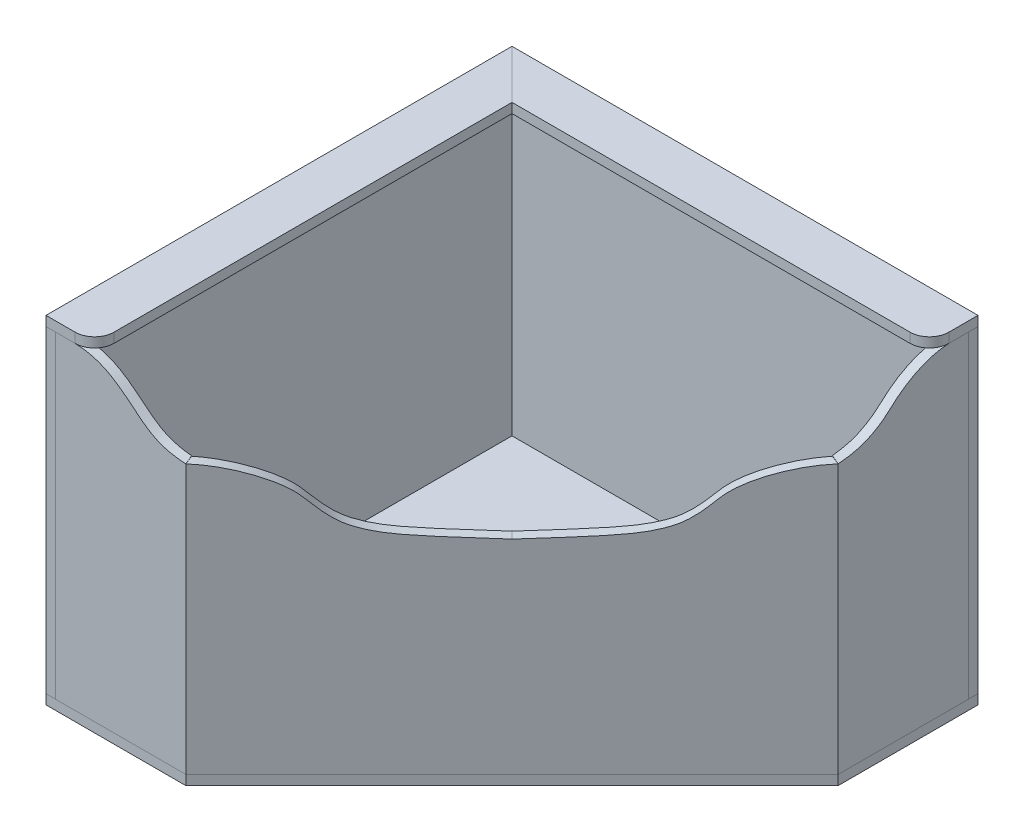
ISO-10303-21;
HEADER;
FILE_DESCRIPTION(('STEP AP214'),'2;1');
FILE_NAME('part.step','',(''),(''),'','','');
FILE_SCHEMA(('AUTOMOTIVE_DESIGN { 1 0 10303 214 1 1 1 1 }'));
ENDSEC;
DATA;
#1=APPLICATION_CONTEXT('core data for automotive mechanical design processes');
#2=APPLICATION_PROTOCOL_DEFINITION('international standard','automotive_design',2000,#1);
#3=PRODUCT_CONTEXT('',#1,'mechanical');
#4=PRODUCT('Part','Part','',(#3));
#5=PRODUCT_RELATED_PRODUCT_CATEGORY('part','',(#4));
#6=PRODUCT_DEFINITION_FORMATION('','',#4);
#7=PRODUCT_DEFINITION_CONTEXT('part definition',#1,'design');
#8=PRODUCT_DEFINITION('design','',#6,#7);
#9=PRODUCT_DEFINITION_SHAPE('','',#8);
#10=(LENGTH_UNIT() NAMED_UNIT(*) SI_UNIT(.MILLI.,.METRE.));
#11=(NAMED_UNIT(*) PLANE_ANGLE_UNIT() SI_UNIT($,.RADIAN.));
#12=(NAMED_UNIT(*) SI_UNIT($,.STERADIAN.) SOLID_ANGLE_UNIT());
#13=UNCERTAINTY_MEASURE_WITH_UNIT(LENGTH_MEASURE(1.E-05),#10,'distance_accuracy_value','');
#14=(GEOMETRIC_REPRESENTATION_CONTEXT(3) GLOBAL_UNCERTAINTY_ASSIGNED_CONTEXT((#13)) GLOBAL_UNIT_ASSIGNED_CONTEXT((#10,
#11,#12)) REPRESENTATION_CONTEXT('',''));
#15=CARTESIAN_POINT('',(0.,0.,0.));
#16=DIRECTION('',(0.,0.,1.));
#17=DIRECTION('',(1.,0.,0.));
#18=AXIS2_PLACEMENT_3D('',#15,#16,#17);
#19=CARTESIAN_POINT('',(76.1999999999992,857.25,0.));
#20=DIRECTION('',(0.,0.,-1.));
#21=DIRECTION('',(-1.,0.,0.));
#22=AXIS2_PLACEMENT_3D('',#19,#20,#21);
#23=PLANE('',#22);
#24=DIRECTION('',(1.,0.,0.));
#25=VECTOR('',#24,1.);
#26=CARTESIAN_POINT('',(76.1999999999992,831.85,0.));
#27=LINE('',#26,#25);
#28=CARTESIAN_POINT('',(0.,831.85,0.));
#29=VERTEX_POINT('',#28);
#30=CARTESIAN_POINT('',(76.1999999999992,831.85,0.));
#31=VERTEX_POINT('',#30);
#32=EDGE_CURVE('E124',#29,#31,#27,.T.);
#33=ORIENTED_EDGE('',*,*,#32,.T.);
#34=DIRECTION('',(0.,-1.,0.));
#35=VECTOR('',#34,1.);
#36=CARTESIAN_POINT('',(76.1999999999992,857.25,0.));
#37=LINE('',#36,#35);
#38=CARTESIAN_POINT('',(76.1999999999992,857.25,0.));
#39=VERTEX_POINT('',#38);
#40=EDGE_CURVE('E12',#39,#31,#37,.T.);
#41=ORIENTED_EDGE('',*,*,#40,.F.);
#42=DIRECTION('',(1.,0.,0.));
#43=VECTOR('',#42,1.);
#44=CARTESIAN_POINT('',(76.1999999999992,857.25,0.));
#45=LINE('',#44,#43);
#46=CARTESIAN_POINT('',(0.,857.25,0.));
#47=VERTEX_POINT('',#46);
#48=EDGE_CURVE('E132',#47,#39,#45,.T.);
#49=ORIENTED_EDGE('',*,*,#48,.F.);
#50=DIRECTION('',(0.,-1.,0.));
#51=VECTOR('',#50,1.);
#52=CARTESIAN_POINT('',(0.,857.25,0.));
#53=LINE('',#52,#51);
#54=EDGE_CURVE('E120',#47,#29,#53,.T.);
#55=ORIENTED_EDGE('',*,*,#54,.T.);
#56=EDGE_LOOP('',(#33,#41,#49,#55));
#57=FACE_BOUND('',#56,.T.);
#58=ADVANCED_FACE('F50',(#57),#23,.F.);
#59=CARTESIAN_POINT('',(76.1999999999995,857.25,-50.8));
#60=DIRECTION('',(0.,-1.,0.));
#61=DIRECTION('',(0.,0.,-1.));
#62=AXIS2_PLACEMENT_3D('',#59,#60,#61);
#63=CYLINDRICAL_SURFACE('',#62,50.8);
#64=CARTESIAN_POINT('',(76.1999999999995,831.85,-50.8));
#65=DIRECTION('',(0.,1.,0.));
#66=DIRECTION('',(0.,0.,-1.));
#67=AXIS2_PLACEMENT_3D('',#64,#65,#66);
#68=CIRCLE('',#67,50.8);
#69=CARTESIAN_POINT('',(127.,831.85,-50.8000000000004));
#70=VERTEX_POINT('',#69);
#71=EDGE_CURVE('E127',#31,#70,#68,.T.);
#72=ORIENTED_EDGE('',*,*,#71,.T.);
#73=DIRECTION('',(0.,-1.,0.));
#74=VECTOR('',#73,1.);
#75=CARTESIAN_POINT('',(127.,857.25,-50.8000000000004));
#76=LINE('',#75,#74);
#77=CARTESIAN_POINT('',(127.,857.25,-50.8000000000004));
#78=VERTEX_POINT('',#77);
#79=EDGE_CURVE('E58',#78,#70,#76,.T.);
#80=ORIENTED_EDGE('',*,*,#79,.F.);
#81=CARTESIAN_POINT('',(76.1999999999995,857.25,-50.8));
#82=DIRECTION('',(0.,1.,0.));
#83=DIRECTION('',(0.,0.,-1.));
#84=AXIS2_PLACEMENT_3D('',#81,#82,#83);
#85=CIRCLE('',#84,50.8);
#86=EDGE_CURVE('E100',#39,#78,#85,.T.);
#87=ORIENTED_EDGE('',*,*,#86,.F.);
#88=ORIENTED_EDGE('',*,*,#40,.T.);
#89=EDGE_LOOP('',(#72,#80,#87,#88));
#90=FACE_BOUND('',#89,.T.);
#91=ADVANCED_FACE('F151',(#90),#63,.T.);
#92=CARTESIAN_POINT('',(127.,857.25,-1092.2));
#93=DIRECTION('',(-1.,0.,0.));
#94=DIRECTION('',(0.,0.,1.));
#95=AXIS2_PLACEMENT_3D('',#92,#93,#94);
#96=PLANE('',#95);
#97=DIRECTION('',(0.,0.,-1.));
#98=VECTOR('',#97,1.);
#99=CARTESIAN_POINT('',(127.,831.85,-1092.2));
#100=LINE('',#99,#98);
#101=CARTESIAN_POINT('',(127.,831.85,-1092.2));
#102=VERTEX_POINT('',#101);
#103=EDGE_CURVE('E115',#70,#102,#100,.T.);
#104=ORIENTED_EDGE('',*,*,#103,.T.);
#105=DIRECTION('',(0.,-1.,0.));
#106=VECTOR('',#105,1.);
#107=CARTESIAN_POINT('',(127.,857.25,-1092.2));
#108=LINE('',#107,#106);
#109=CARTESIAN_POINT('',(127.,857.25,-1092.2));
#110=VERTEX_POINT('',#109);
#111=EDGE_CURVE('E112',#110,#102,#108,.T.);
#112=ORIENTED_EDGE('',*,*,#111,.F.);
#113=DIRECTION('',(0.,0.,-1.));
#114=VECTOR('',#113,1.);
#115=CARTESIAN_POINT('',(127.,857.25,-1092.2));
#116=LINE('',#115,#114);
#117=EDGE_CURVE('E104',#78,#110,#116,.T.);
#118=ORIENTED_EDGE('',*,*,#117,.F.);
#119=ORIENTED_EDGE('',*,*,#79,.T.);
#120=EDGE_LOOP('',(#104,#112,#118,#119));
#121=FACE_BOUND('',#120,.T.);
#122=ADVANCED_FACE('F113',(#121),#96,.F.);
#123=CARTESIAN_POINT('',(0.,857.25,-1219.2));
#124=DIRECTION('',(-0.707106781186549,0.,0.707106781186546));
#125=DIRECTION('',(0.707106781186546,0.,0.707106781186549));
#126=AXIS2_PLACEMENT_3D('',#123,#124,#125);
#127=PLANE('',#126);
#128=DIRECTION('',(-0.707106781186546,0.,-0.707106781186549));
#129=VECTOR('',#128,1.);
#130=CARTESIAN_POINT('',(0.,831.85,-1219.2));
#131=LINE('',#130,#129);
#132=CARTESIAN_POINT('',(0.,831.85,-1219.2));
#133=VERTEX_POINT('',#132);
#134=EDGE_CURVE('E86',#102,#133,#131,.T.);
#135=ORIENTED_EDGE('',*,*,#134,.T.);
#136=DIRECTION('',(0.,-1.,0.));
#137=VECTOR('',#136,1.);
#138=CARTESIAN_POINT('',(0.,857.25,-1219.2));
#139=LINE('',#138,#137);
#140=CARTESIAN_POINT('',(0.,857.25,-1219.2));
#141=VERTEX_POINT('',#140);
#142=EDGE_CURVE('E116',#141,#133,#139,.T.);
#143=ORIENTED_EDGE('',*,*,#142,.F.);
#144=DIRECTION('',(-0.707106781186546,0.,-0.707106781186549));
#145=VECTOR('',#144,1.);
#146=CARTESIAN_POINT('',(0.,857.25,-1219.2));
#147=LINE('',#146,#145);
#148=EDGE_CURVE('E108',#110,#141,#147,.T.);
#149=ORIENTED_EDGE('',*,*,#148,.F.);
#150=ORIENTED_EDGE('',*,*,#111,.T.);
#151=EDGE_LOOP('',(#135,#143,#149,#150));
#152=FACE_BOUND('',#151,.T.);
#153=ADVANCED_FACE('F118',(#152),#127,.F.);
#154=CARTESIAN_POINT('',(0.,857.25,0.));
#155=DIRECTION('',(1.,0.,0.));
#156=DIRECTION('',(0.,0.,-1.));
#157=AXIS2_PLACEMENT_3D('',#154,#155,#156);
#158=PLANE('',#157);
#159=DIRECTION('',(0.,0.,1.));
#160=VECTOR('',#159,1.);
#161=CARTESIAN_POINT('',(0.,831.85,0.));
#162=LINE('',#161,#160);
#163=EDGE_CURVE('E92',#133,#29,#162,.T.);
#164=ORIENTED_EDGE('',*,*,#163,.T.);
#165=ORIENTED_EDGE('',*,*,#54,.F.);
#166=DIRECTION('',(0.,0.,1.));
#167=VECTOR('',#166,1.);
#168=CARTESIAN_POINT('',(0.,857.25,0.));
#169=LINE('',#168,#167);
#170=EDGE_CURVE('E66',#141,#47,#169,.T.);
#171=ORIENTED_EDGE('',*,*,#170,.F.);
#172=ORIENTED_EDGE('',*,*,#142,.T.);
#173=EDGE_LOOP('',(#164,#165,#171,#172));
#174=FACE_BOUND('',#173,.T.);
#175=ADVANCED_FACE('F140',(#174),#158,.F.);
#176=CARTESIAN_POINT('',(76.1999999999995,857.25,-50.8));
#177=DIRECTION('',(0.,-1.,0.));
#178=DIRECTION('',(0.,0.,-1.));
#179=AXIS2_PLACEMENT_3D('',#176,#177,#178);
#180=PLANE('',#179);
#181=ORIENTED_EDGE('',*,*,#48,.T.);
#182=ORIENTED_EDGE('',*,*,#86,.T.);
#183=ORIENTED_EDGE('',*,*,#117,.T.);
#184=ORIENTED_EDGE('',*,*,#148,.T.);
#185=ORIENTED_EDGE('',*,*,#170,.T.);
#186=EDGE_LOOP('',(#181,#182,#183,#184,#185));
#187=FACE_BOUND('',#186,.T.);
#188=ADVANCED_FACE('F106',(#187),#180,.F.);
#189=CARTESIAN_POINT('',(76.1999999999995,831.85,-50.8));
#190=DIRECTION('',(0.,-1.,0.));
#191=DIRECTION('',(0.,0.,-1.));
#192=AXIS2_PLACEMENT_3D('',#189,#190,#191);
#193=PLANE('',#192);
#194=ORIENTED_EDGE('',*,*,#32,.F.);
#195=ORIENTED_EDGE('',*,*,#163,.F.);
#196=ORIENTED_EDGE('',*,*,#134,.F.);
#197=ORIENTED_EDGE('',*,*,#103,.F.);
#198=ORIENTED_EDGE('',*,*,#71,.F.);
#199=EDGE_LOOP('',(#194,#195,#196,#197,#198));
#200=FACE_BOUND('',#199,.T.);
#201=ADVANCED_FACE('F136',(#200),#193,.T.);
#202=CLOSED_SHELL('',(#58,#91,#122,#153,#175,#188,#201));
#203=MANIFOLD_SOLID_BREP('B2',#202);
#204=CARTESIAN_POINT('',(0.,857.25,-1219.2));
#205=DIRECTION('',(0.,0.,1.));
#206=DIRECTION('',(1.,0.,0.));
#207=AXIS2_PLACEMENT_3D('',#204,#205,#206);
#208=PLANE('',#207);
#209=DIRECTION('',(-1.,0.,0.));
#210=VECTOR('',#209,1.);
#211=CARTESIAN_POINT('',(0.,831.85,-1219.2));
#212=LINE('',#211,#210);
#213=CARTESIAN_POINT('',(1219.2,831.85,-1219.2));
#214=VERTEX_POINT('',#213);
#215=CARTESIAN_POINT('',(0.,831.85,-1219.2));
#216=VERTEX_POINT('',#215);
#217=EDGE_CURVE('E284',#214,#216,#212,.T.);
#218=ORIENTED_EDGE('',*,*,#217,.T.);
#219=DIRECTION('',(0.,-1.,0.));
#220=VECTOR('',#219,1.);
#221=CARTESIAN_POINT('',(0.,857.25,-1219.2));
#222=LINE('',#221,#220);
#223=CARTESIAN_POINT('',(0.,857.25,-1219.2));
#224=VERTEX_POINT('',#223);
#225=EDGE_CURVE('E48',#224,#216,#222,.T.);
#226=ORIENTED_EDGE('',*,*,#225,.F.);
#227=DIRECTION('',(-1.,0.,0.));
#228=VECTOR('',#227,1.);
#229=CARTESIAN_POINT('',(0.,857.25,-1219.2));
#230=LINE('',#229,#228);
#231=CARTESIAN_POINT('',(1219.2,857.25,-1219.2));
#232=VERTEX_POINT('',#231);
#233=EDGE_CURVE('E292',#232,#224,#230,.T.);
#234=ORIENTED_EDGE('',*,*,#233,.F.);
#235=DIRECTION('',(0.,-1.,0.));
#236=VECTOR('',#235,1.);
#237=CARTESIAN_POINT('',(1219.2,857.25,-1219.2));
#238=LINE('',#237,#236);
#239=EDGE_CURVE('E280',#232,#214,#238,.T.);
#240=ORIENTED_EDGE('',*,*,#239,.T.);
#241=EDGE_LOOP('',(#218,#226,#234,#240));
#242=FACE_BOUND('',#241,.T.);
#243=ADVANCED_FACE('F210',(#242),#208,.F.);
#244=CARTESIAN_POINT('',(0.,857.25,-1219.2));
#245=DIRECTION('',(0.707106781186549,0.,-0.707106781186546));
#246=DIRECTION('',(-0.707106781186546,0.,-0.707106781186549));
#247=AXIS2_PLACEMENT_3D('',#244,#245,#246);
#248=PLANE('',#247);
#249=DIRECTION('',(0.707106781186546,0.,0.707106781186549));
#250=VECTOR('',#249,1.);
#251=CARTESIAN_POINT('',(0.,831.85,-1219.2));
#252=LINE('',#251,#250);
#253=CARTESIAN_POINT('',(127.,831.85,-1092.2));
#254=VERTEX_POINT('',#253);
#255=EDGE_CURVE('E287',#216,#254,#252,.T.);
#256=ORIENTED_EDGE('',*,*,#255,.T.);
#257=DIRECTION('',(0.,-1.,0.));
#258=VECTOR('',#257,1.);
#259=CARTESIAN_POINT('',(127.,857.25,-1092.2));
#260=LINE('',#259,#258);
#261=CARTESIAN_POINT('',(127.,857.25,-1092.2));
#262=VERTEX_POINT('',#261);
#263=EDGE_CURVE('E218',#262,#254,#260,.T.);
#264=ORIENTED_EDGE('',*,*,#263,.F.);
#265=DIRECTION('',(0.707106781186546,0.,0.707106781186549));
#266=VECTOR('',#265,1.);
#267=CARTESIAN_POINT('',(0.,857.25,-1219.2));
#268=LINE('',#267,#266);
#269=EDGE_CURVE('E260',#224,#262,#268,.T.);
#270=ORIENTED_EDGE('',*,*,#269,.F.);
#271=ORIENTED_EDGE('',*,*,#225,.T.);
#272=EDGE_LOOP('',(#256,#264,#270,#271));
#273=FACE_BOUND('',#272,.T.);
#274=ADVANCED_FACE('F311',(#273),#248,.F.);
#275=CARTESIAN_POINT('',(127.,857.25,-1092.2));
#276=DIRECTION('',(0.,0.,-1.));
#277=DIRECTION('',(-1.,0.,0.));
#278=AXIS2_PLACEMENT_3D('',#275,#276,#277);
#279=PLANE('',#278);
#280=DIRECTION('',(1.,0.,0.));
#281=VECTOR('',#280,1.);
#282=CARTESIAN_POINT('',(127.,831.85,-1092.2));
#283=LINE('',#282,#281);
#284=CARTESIAN_POINT('',(1168.4,831.85,-1092.2));
#285=VERTEX_POINT('',#284);
#286=EDGE_CURVE('E275',#254,#285,#283,.T.);
#287=ORIENTED_EDGE('',*,*,#286,.T.);
#288=DIRECTION('',(0.,-1.,0.));
#289=VECTOR('',#288,1.);
#290=CARTESIAN_POINT('',(1168.4,857.25,-1092.2));
#291=LINE('',#290,#289);
#292=CARTESIAN_POINT('',(1168.4,857.25,-1092.2));
#293=VERTEX_POINT('',#292);
#294=EDGE_CURVE('E272',#293,#285,#291,.T.);
#295=ORIENTED_EDGE('',*,*,#294,.F.);
#296=DIRECTION('',(1.,0.,0.));
#297=VECTOR('',#296,1.);
#298=CARTESIAN_POINT('',(127.,857.25,-1092.2));
#299=LINE('',#298,#297);
#300=EDGE_CURVE('E264',#262,#293,#299,.T.);
#301=ORIENTED_EDGE('',*,*,#300,.F.);
#302=ORIENTED_EDGE('',*,*,#263,.T.);
#303=EDGE_LOOP('',(#287,#295,#301,#302));
#304=FACE_BOUND('',#303,.T.);
#305=ADVANCED_FACE('F273',(#304),#279,.F.);
#306=CARTESIAN_POINT('',(1168.4,857.25,-1143.));
#307=DIRECTION('',(0.,-1.,0.));
#308=DIRECTION('',(0.,0.,-1.));
#309=AXIS2_PLACEMENT_3D('',#306,#307,#308);
#310=CYLINDRICAL_SURFACE('',#309,50.8);
#311=CARTESIAN_POINT('',(1168.4,831.85,-1143.));
#312=DIRECTION('',(0.,1.,0.));
#313=DIRECTION('',(0.,0.,1.));
#314=AXIS2_PLACEMENT_3D('',#311,#312,#313);
#315=CIRCLE('',#314,50.8);
#316=CARTESIAN_POINT('',(1219.2,831.85,-1143.));
#317=VERTEX_POINT('',#316);
#318=EDGE_CURVE('E246',#285,#317,#315,.T.);
#319=ORIENTED_EDGE('',*,*,#318,.T.);
#320=DIRECTION('',(0.,-1.,0.));
#321=VECTOR('',#320,1.);
#322=CARTESIAN_POINT('',(1219.2,857.25,-1143.));
#323=LINE('',#322,#321);
#324=CARTESIAN_POINT('',(1219.2,857.25,-1143.));
#325=VERTEX_POINT('',#324);
#326=EDGE_CURVE('E276',#325,#317,#323,.T.);
#327=ORIENTED_EDGE('',*,*,#326,.F.);
#328=CARTESIAN_POINT('',(1168.4,857.25,-1143.));
#329=DIRECTION('',(0.,1.,0.));
#330=DIRECTION('',(0.,0.,1.));
#331=AXIS2_PLACEMENT_3D('',#328,#329,#330);
#332=CIRCLE('',#331,50.8);
#333=EDGE_CURVE('E268',#293,#325,#332,.T.);
#334=ORIENTED_EDGE('',*,*,#333,.F.);
#335=ORIENTED_EDGE('',*,*,#294,.T.);
#336=EDGE_LOOP('',(#319,#327,#334,#335));
#337=FACE_BOUND('',#336,.T.);
#338=ADVANCED_FACE('F278',(#337),#310,.T.);
#339=CARTESIAN_POINT('',(1219.2,857.25,-1143.));
#340=DIRECTION('',(-1.,0.,0.));
#341=DIRECTION('',(0.,0.,1.));
#342=AXIS2_PLACEMENT_3D('',#339,#340,#341);
#343=PLANE('',#342);
#344=DIRECTION('',(0.,0.,-1.));
#345=VECTOR('',#344,1.);
#346=CARTESIAN_POINT('',(1219.2,831.85,-1143.));
#347=LINE('',#346,#345);
#348=EDGE_CURVE('E252',#317,#214,#347,.T.);
#349=ORIENTED_EDGE('',*,*,#348,.T.);
#350=ORIENTED_EDGE('',*,*,#239,.F.);
#351=DIRECTION('',(0.,0.,-1.));
#352=VECTOR('',#351,1.);
#353=CARTESIAN_POINT('',(1219.2,857.25,-1143.));
#354=LINE('',#353,#352);
#355=EDGE_CURVE('E226',#325,#232,#354,.T.);
#356=ORIENTED_EDGE('',*,*,#355,.F.);
#357=ORIENTED_EDGE('',*,*,#326,.T.);
#358=EDGE_LOOP('',(#349,#350,#356,#357));
#359=FACE_BOUND('',#358,.T.);
#360=ADVANCED_FACE('F300',(#359),#343,.F.);
#361=CARTESIAN_POINT('',(1168.4,857.25,-1143.));
#362=DIRECTION('',(0.,1.,0.));
#363=DIRECTION('',(0.,0.,1.));
#364=AXIS2_PLACEMENT_3D('',#361,#362,#363);
#365=PLANE('',#364);
#366=ORIENTED_EDGE('',*,*,#233,.T.);
#367=ORIENTED_EDGE('',*,*,#269,.T.);
#368=ORIENTED_EDGE('',*,*,#300,.T.);
#369=ORIENTED_EDGE('',*,*,#333,.T.);
#370=ORIENTED_EDGE('',*,*,#355,.T.);
#371=EDGE_LOOP('',(#366,#367,#368,#369,#370));
#372=FACE_BOUND('',#371,.T.);
#373=ADVANCED_FACE('F266',(#372),#365,.T.);
#374=CARTESIAN_POINT('',(1168.4,831.85,-1143.));
#375=DIRECTION('',(0.,1.,0.));
#376=DIRECTION('',(0.,0.,1.));
#377=AXIS2_PLACEMENT_3D('',#374,#375,#376);
#378=PLANE('',#377);
#379=ORIENTED_EDGE('',*,*,#217,.F.);
#380=ORIENTED_EDGE('',*,*,#348,.F.);
#381=ORIENTED_EDGE('',*,*,#318,.F.);
#382=ORIENTED_EDGE('',*,*,#286,.F.);
#383=ORIENTED_EDGE('',*,*,#255,.F.);
#384=EDGE_LOOP('',(#379,#380,#381,#382,#383));
#385=FACE_BOUND('',#384,.T.);
#386=ADVANCED_FACE('F296',(#385),#378,.F.);
#387=CLOSED_SHELL('',(#243,#274,#305,#338,#360,#373,#386));
#388=MANIFOLD_SOLID_BREP('B6',#387);
#389=CARTESIAN_POINT('',(0.,0.,0.));
#390=DIRECTION('',(0.,-1.,0.));
#391=DIRECTION('',(0.,0.,-1.));
#392=AXIS2_PLACEMENT_3D('',#389,#390,#391);
#393=PLANE('',#392);
#394=DIRECTION('',(0.707106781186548,0.,-0.707106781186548));
#395=VECTOR('',#394,1.);
#396=CARTESIAN_POINT('',(1219.2,0.,-853.078975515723));
#397=LINE('',#396,#395);
#398=CARTESIAN_POINT('',(366.121024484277,0.,0.));
#399=VERTEX_POINT('',#398);
#400=CARTESIAN_POINT('',(1219.2,0.,-853.078975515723));
#401=VERTEX_POINT('',#400);
#402=EDGE_CURVE('E434',#399,#401,#397,.T.);
#403=ORIENTED_EDGE('',*,*,#402,.F.);
#404=DIRECTION('',(0.382683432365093,0.,0.923879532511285));
#405=VECTOR('',#404,1.);
#406=CARTESIAN_POINT('',(366.121024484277,0.,0.));
#407=LINE('',#406,#405);
#408=CARTESIAN_POINT('',(355.6,0.,-25.4));
#409=VERTEX_POINT('',#408);
#410=EDGE_CURVE('E449',#409,#399,#407,.T.);
#411=ORIENTED_EDGE('',*,*,#410,.F.);
#412=DIRECTION('',(-0.707106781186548,0.,0.707106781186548));
#413=VECTOR('',#412,1.);
#414=CARTESIAN_POINT('',(355.6,0.,-25.4));
#415=LINE('',#414,#413);
#416=CARTESIAN_POINT('',(1193.8,0.,-863.6));
#417=VERTEX_POINT('',#416);
#418=EDGE_CURVE('E436',#417,#409,#415,.T.);
#419=ORIENTED_EDGE('',*,*,#418,.F.);
#420=DIRECTION('',(-0.923879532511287,0.,-0.382683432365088));
#421=VECTOR('',#420,1.);
#422=CARTESIAN_POINT('',(1193.8,0.,-863.6));
#423=LINE('',#422,#421);
#424=EDGE_CURVE('E422',#401,#417,#423,.T.);
#425=ORIENTED_EDGE('',*,*,#424,.F.);
#426=EDGE_LOOP('',(#403,#411,#419,#425));
#427=FACE_BOUND('',#426,.T.);
#428=ADVANCED_FACE('F370',(#427),#393,.T.);
#429=CARTESIAN_POINT('',(366.121024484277,831.851,0.));
#430=DIRECTION('',(0.923879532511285,0.,-0.382683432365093));
#431=DIRECTION('',(-0.382683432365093,0.,-0.923879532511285));
#432=AXIS2_PLACEMENT_3D('',#429,#430,#431);
#433=PLANE('',#432);
#434=DIRECTION('',(0.,-1.,0.));
#435=VECTOR('',#434,1.);
#436=CARTESIAN_POINT('',(366.121024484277,831.851,0.));
#437=LINE('',#436,#435);
#438=CARTESIAN_POINT('',(366.121024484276,703.815722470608,3.60822483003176E-13));
#439=VERTEX_POINT('',#438);
#440=EDGE_CURVE('E439',#439,#399,#437,.T.);
#441=ORIENTED_EDGE('',*,*,#440,.F.);
#442=CARTESIAN_POINT('',(366.121024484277,703.815722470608,1.87350135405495E-13));
#443=CARTESIAN_POINT('',(365.682591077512,703.797159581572,-1.05847187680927));
#444=CARTESIAN_POINT('',(365.244163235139,703.77770131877,-2.11693031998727));
#445=CARTESIAN_POINT('',(364.367322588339,703.737013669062,-4.2338109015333));
#446=CARTESIAN_POINT('',(363.928909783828,703.715784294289,-5.29223304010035));
#447=CARTESIAN_POINT('',(363.05209907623,703.671573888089,-7.409041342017));
#448=CARTESIAN_POINT('',(362.613701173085,703.648592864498,-8.46742750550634));
#449=CARTESIAN_POINT('',(361.736920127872,703.600897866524,-10.584164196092));
#450=CARTESIAN_POINT('',(361.298536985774,703.576183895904,-11.6425147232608));
#451=CARTESIAN_POINT('',(360.421785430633,703.525041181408,-13.7591802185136));
#452=CARTESIAN_POINT('',(359.983417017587,703.498612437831,-14.8174951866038));
#453=CARTESIAN_POINT('',(359.106694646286,703.444057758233,-16.9340902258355));
#454=CARTESIAN_POINT('',(358.668340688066,703.415931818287,-17.9923702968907));
#455=CARTESIAN_POINT('',(357.791647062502,703.357999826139,-20.1088959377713));
#456=CARTESIAN_POINT('',(357.353307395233,703.328193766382,-21.1671415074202));
#457=CARTESIAN_POINT('',(356.476642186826,703.266917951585,-23.2835985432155));
#458=CARTESIAN_POINT('',(356.038316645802,703.235448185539,-24.34181000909));
#459=CARTESIAN_POINT('',(355.600000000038,703.203154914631,-25.3999999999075));
#460=B_SPLINE_CURVE_WITH_KNOTS('',3,(#442,#443,#444,#445,#446,#447,#448,#449,#450,#451,#452,
#453,#454,#455,#456,#457,#458,#459),.UNSPECIFIED.,.F.,.F.,(4,2,2,2,2,2,2,2,4),(0.,
3.43749583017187,6.87496811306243,10.3124250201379,13.7498744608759,17.187323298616,
20.6247800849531,24.0622523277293,27.4997473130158),.UNSPECIFIED.);
#461=CARTESIAN_POINT('',(355.6,703.203154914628,-25.4));
#462=VERTEX_POINT('',#461);
#463=EDGE_CURVE('E390',#439,#462,#460,.T.);
#464=ORIENTED_EDGE('',*,*,#463,.T.);
#465=DIRECTION('',(0.,-1.,0.));
#466=VECTOR('',#465,1.);
#467=CARTESIAN_POINT('',(355.6,831.851,-25.4));
#468=LINE('',#467,#466);
#469=EDGE_CURVE('E452',#462,#409,#468,.T.);
#470=ORIENTED_EDGE('',*,*,#469,.T.);
#471=ORIENTED_EDGE('',*,*,#410,.T.);
#472=EDGE_LOOP('',(#441,#464,#470,#471));
#473=FACE_BOUND('',#472,.T.);
#474=ADVANCED_FACE('F465',(#473),#433,.F.);
#475=CARTESIAN_POINT('',(355.6,831.851,-25.4));
#476=DIRECTION('',(0.707106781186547,0.,0.707106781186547));
#477=DIRECTION('',(0.707106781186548,0.,-0.707106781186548));
#478=AXIS2_PLACEMENT_3D('',#475,#476,#477);
#479=PLANE('',#478);
#480=CARTESIAN_POINT('',(774.7,533.4,-444.5));
#481=CARTESIAN_POINT('',(653.950794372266,539.913589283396,-323.750794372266));
#482=CARTESIAN_POINT('',(612.359855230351,544.516452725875,-282.159855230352));
#483=CARTESIAN_POINT('',(558.49444223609,564.719403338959,-228.29444223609));
#484=CARTESIAN_POINT('',(535.096133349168,581.475854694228,-204.896133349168));
#485=CARTESIAN_POINT('',(476.347405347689,665.034466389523,-146.14740534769));
#486=CARTESIAN_POINT('',(399.493808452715,700.742078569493,-69.2938084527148));
#487=CARTESIAN_POINT('',(348.160512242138,703.815722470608,-17.960512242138));
#488=B_SPLINE_CURVE_WITH_KNOTS('',3,(#480,#481,#482,#483,#484,#485,#486,#487),.UNSPECIFIED.,.F.,
.F.,(4,1,1,1,1,4),(0.,0.332635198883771,0.406350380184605,0.700396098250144,0.763436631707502,
1.),.UNSPECIFIED.);
#489=CARTESIAN_POINT('',(774.7,533.4,-444.5));
#490=VERTEX_POINT('',#489);
#491=EDGE_CURVE('E461',#462,#490,#488,.F.);
#492=ORIENTED_EDGE('',*,*,#491,.T.);
#493=CARTESIAN_POINT('',(1201.23948775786,703.815722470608,-871.039487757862));
#494=CARTESIAN_POINT('',(1149.90619154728,700.742078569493,-819.706191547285));
#495=CARTESIAN_POINT('',(1073.05259465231,665.034466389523,-742.852594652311));
#496=CARTESIAN_POINT('',(1014.30386665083,581.475854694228,-684.103866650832));
#497=CARTESIAN_POINT('',(990.90555776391,564.719403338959,-660.70555776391));
#498=CARTESIAN_POINT('',(937.040144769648,544.516452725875,-606.840144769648));
#499=CARTESIAN_POINT('',(895.449205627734,539.913589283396,-565.249205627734));
#500=CARTESIAN_POINT('',(774.7,533.4,-444.5));
#501=B_SPLINE_CURVE_WITH_KNOTS('',3,(#493,#494,#495,#496,#497,#498,#499,#500),.UNSPECIFIED.,.F.,
.F.,(4,1,1,1,1,4),(0.,0.236563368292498,0.299603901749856,0.593649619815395,0.667364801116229,
1.),.UNSPECIFIED.);
#502=CARTESIAN_POINT('',(1193.80000000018,703.203154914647,-863.600000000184));
#503=VERTEX_POINT('',#502);
#504=EDGE_CURVE('E503',#490,#503,#501,.F.);
#505=ORIENTED_EDGE('',*,*,#504,.T.);
#506=DIRECTION('',(0.,-1.,0.));
#507=VECTOR('',#506,1.);
#508=CARTESIAN_POINT('',(1193.8,831.851,-863.6));
#509=LINE('',#508,#507);
#510=EDGE_CURVE('E429',#503,#417,#509,.T.);
#511=ORIENTED_EDGE('',*,*,#510,.T.);
#512=ORIENTED_EDGE('',*,*,#418,.T.);
#513=ORIENTED_EDGE('',*,*,#469,.F.);
#514=EDGE_LOOP('',(#492,#505,#511,#512,#513));
#515=FACE_BOUND('',#514,.T.);
#516=ADVANCED_FACE('F494',(#515),#479,.F.);
#517=CARTESIAN_POINT('',(1193.8,831.851,-863.6));
#518=DIRECTION('',(-0.382683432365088,0.,0.923879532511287));
#519=DIRECTION('',(0.923879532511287,0.,0.382683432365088));
#520=AXIS2_PLACEMENT_3D('',#517,#518,#519);
#521=PLANE('',#520);
#522=ORIENTED_EDGE('',*,*,#510,.F.);
#523=CARTESIAN_POINT('',(1193.8,703.203154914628,-863.6));
#524=CARTESIAN_POINT('',(1194.85818999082,703.235448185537,-863.161683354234));
#525=CARTESIAN_POINT('',(1195.9164014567,703.266917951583,-862.723357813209));
#526=CARTESIAN_POINT('',(1198.0328584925,703.328193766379,-861.846692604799));
#527=CARTESIAN_POINT('',(1199.09110406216,703.357999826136,-861.408352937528));
#528=CARTESIAN_POINT('',(1201.20762970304,703.415931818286,-860.531659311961));
#529=CARTESIAN_POINT('',(1202.2659097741,703.444057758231,-860.09330535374));
#530=CARTESIAN_POINT('',(1204.38250481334,703.49861243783,-859.216582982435));
#531=CARTESIAN_POINT('',(1205.44081978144,703.525041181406,-858.778214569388));
#532=CARTESIAN_POINT('',(1207.5574852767,703.576183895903,-857.901463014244));
#533=CARTESIAN_POINT('',(1208.61583580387,703.600897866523,-857.463079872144));
#534=CARTESIAN_POINT('',(1210.73257249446,703.648592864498,-856.586298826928));
#535=CARTESIAN_POINT('',(1211.79095865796,703.671573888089,-856.147900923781));
#536=CARTESIAN_POINT('',(1213.90776695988,703.715784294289,-855.27109021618));
#537=CARTESIAN_POINT('',(1214.96618909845,703.737013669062,-854.832677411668));
#538=CARTESIAN_POINT('',(1217.08306968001,703.77770131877,-853.955836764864));
#539=CARTESIAN_POINT('',(1218.14152812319,703.797159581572,-853.51740892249));
#540=CARTESIAN_POINT('',(1219.2,703.815722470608,-853.078975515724));
#541=B_SPLINE_CURVE_WITH_KNOTS('',3,(#523,#524,#525,#526,#527,#528,#529,#530,#531,#532,#533,
#534,#535,#536,#537,#538,#539,#540),.UNSPECIFIED.,.F.,.F.,(4,2,2,2,2,2,2,2,4),(0.,
3.43749498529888,6.87496722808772,10.3124240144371,13.7498728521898,17.1873222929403,
20.6247792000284,24.0622514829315,27.4997473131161),.UNSPECIFIED.);
#542=CARTESIAN_POINT('',(1219.2,703.815722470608,-853.078975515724));
#543=VERTEX_POINT('',#542);
#544=EDGE_CURVE('E425',#503,#543,#541,.T.);
#545=ORIENTED_EDGE('',*,*,#544,.T.);
#546=DIRECTION('',(0.,-1.,0.));
#547=VECTOR('',#546,1.);
#548=CARTESIAN_POINT('',(1219.2,831.851,-853.078975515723));
#549=LINE('',#548,#547);
#550=EDGE_CURVE('E418',#543,#401,#549,.T.);
#551=ORIENTED_EDGE('',*,*,#550,.T.);
#552=ORIENTED_EDGE('',*,*,#424,.T.);
#553=EDGE_LOOP('',(#522,#545,#551,#552));
#554=FACE_BOUND('',#553,.T.);
#555=ADVANCED_FACE('F421',(#554),#521,.F.);
#556=CARTESIAN_POINT('',(1219.2,831.851,-853.078975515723));
#557=DIRECTION('',(-0.707106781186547,0.,-0.707106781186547));
#558=DIRECTION('',(-0.707106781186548,0.,0.707106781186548));
#559=AXIS2_PLACEMENT_3D('',#556,#557,#558);
#560=PLANE('',#559);
#561=ORIENTED_EDGE('',*,*,#550,.F.);
#562=CARTESIAN_POINT('',(1219.2,703.815722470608,-853.078975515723));
#563=CARTESIAN_POINT('',(1167.86670378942,700.742078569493,-801.745679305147));
#564=CARTESIAN_POINT('',(1091.01310689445,665.034466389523,-724.892082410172));
#565=CARTESIAN_POINT('',(1032.26437889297,581.475854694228,-666.143354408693));
#566=CARTESIAN_POINT('',(1008.86607000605,564.719403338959,-642.745045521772));
#567=CARTESIAN_POINT('',(955.000657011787,544.516452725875,-588.87963252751));
#568=CARTESIAN_POINT('',(913.409717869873,539.913589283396,-547.288693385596));
#569=CARTESIAN_POINT('',(792.660512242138,533.4,-426.539487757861));
#570=B_SPLINE_CURVE_WITH_KNOTS('',3,(#562,#563,#564,#565,#566,#567,#568,#569),.UNSPECIFIED.,.F.,
.F.,(4,1,1,1,1,4),(0.,0.236563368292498,0.299603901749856,0.593649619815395,0.667364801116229,
1.),.UNSPECIFIED.);
#571=CARTESIAN_POINT('',(792.660512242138,533.4,-426.539487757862));
#572=VERTEX_POINT('',#571);
#573=EDGE_CURVE('E374',#543,#572,#570,.T.);
#574=ORIENTED_EDGE('',*,*,#573,.T.);
#575=CARTESIAN_POINT('',(792.660512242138,533.4,-426.539487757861));
#576=CARTESIAN_POINT('',(671.911306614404,539.913589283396,-305.790282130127));
#577=CARTESIAN_POINT('',(630.32036747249,544.516452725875,-264.199342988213));
#578=CARTESIAN_POINT('',(576.454954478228,564.719403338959,-210.333929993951));
#579=CARTESIAN_POINT('',(553.056645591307,581.475854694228,-186.93562110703));
#580=CARTESIAN_POINT('',(494.307917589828,665.034466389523,-128.186893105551));
#581=CARTESIAN_POINT('',(417.454320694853,700.742078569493,-51.3332962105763));
#582=CARTESIAN_POINT('',(366.121024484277,703.815722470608,5.57084040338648E-13));
#583=B_SPLINE_CURVE_WITH_KNOTS('',3,(#575,#576,#577,#578,#579,#580,#581,#582),.UNSPECIFIED.,.F.,
.F.,(4,1,1,1,1,4),(0.,0.332635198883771,0.406350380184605,0.700396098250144,0.763436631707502,
1.),.UNSPECIFIED.);
#584=EDGE_CURVE('E382',#572,#439,#583,.T.);
#585=ORIENTED_EDGE('',*,*,#584,.T.);
#586=ORIENTED_EDGE('',*,*,#440,.T.);
#587=ORIENTED_EDGE('',*,*,#402,.T.);
#588=EDGE_LOOP('',(#561,#574,#585,#586,#587));
#589=FACE_BOUND('',#588,.T.);
#590=ADVANCED_FACE('F372',(#589),#560,.F.);
#591=CARTESIAN_POINT('',(1219.2,703.815722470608,-853.078975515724));
#592=CARTESIAN_POINT('',(1167.86670378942,700.742078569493,-801.745679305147));
#593=CARTESIAN_POINT('',(1091.01310689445,665.034466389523,-724.892082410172));
#594=CARTESIAN_POINT('',(1032.26437889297,581.475854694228,-666.143354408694));
#595=CARTESIAN_POINT('',(1008.86607000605,564.719403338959,-642.745045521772));
#596=CARTESIAN_POINT('',(955.000657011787,544.516452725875,-588.87963252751));
#597=CARTESIAN_POINT('',(913.409717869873,539.913589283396,-547.288693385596));
#598=CARTESIAN_POINT('',(792.660512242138,533.4,-426.539487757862));
#599=B_SPLINE_CURVE_WITH_KNOTS('',3,(#591,#592,#593,#594,#595,#596,#597,#598),.UNSPECIFIED.,.F.,
.F.,(4,1,1,1,1,4),(0.,0.236563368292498,0.299603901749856,0.593649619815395,0.667364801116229,
1.),.UNSPECIFIED.);
#600=DIRECTION('',(-0.707106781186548,0.,-0.707106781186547));
#601=VECTOR('',#600,1.);
#602=SURFACE_OF_LINEAR_EXTRUSION('',#599,#601);
#603=ORIENTED_EDGE('',*,*,#504,.F.);
#604=DIRECTION('',(-0.707106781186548,0.,-0.707106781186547));
#605=VECTOR('',#604,1.);
#606=CARTESIAN_POINT('',(792.660512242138,533.4,-426.539487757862));
#607=LINE('',#606,#605);
#608=EDGE_CURVE('E208',#572,#490,#607,.T.);
#609=ORIENTED_EDGE('',*,*,#608,.F.);
#610=ORIENTED_EDGE('',*,*,#573,.F.);
#611=ORIENTED_EDGE('',*,*,#544,.F.);
#612=EDGE_LOOP('',(#603,#609,#610,#611));
#613=FACE_BOUND('',#612,.T.);
#614=ADVANCED_FACE('F473',(#613),#602,.F.);
#615=CARTESIAN_POINT('',(792.660512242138,533.4,-426.539487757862));
#616=CARTESIAN_POINT('',(671.911306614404,539.913589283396,-305.790282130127));
#617=CARTESIAN_POINT('',(630.32036747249,544.516452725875,-264.199342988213));
#618=CARTESIAN_POINT('',(576.454954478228,564.719403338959,-210.333929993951));
#619=CARTESIAN_POINT('',(553.056645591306,581.475854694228,-186.93562110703));
#620=CARTESIAN_POINT('',(494.307917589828,665.034466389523,-128.186893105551));
#621=CARTESIAN_POINT('',(417.454320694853,700.742078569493,-51.3332962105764));
#622=CARTESIAN_POINT('',(366.121024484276,703.815722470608,3.60822483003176E-13));
#623=B_SPLINE_CURVE_WITH_KNOTS('',3,(#615,#616,#617,#618,#619,#620,#621,#622),.UNSPECIFIED.,.F.,
.F.,(4,1,1,1,1,4),(0.,0.332635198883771,0.406350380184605,0.700396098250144,0.763436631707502,
1.),.UNSPECIFIED.);
#624=DIRECTION('',(-0.707106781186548,0.,-0.707106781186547));
#625=VECTOR('',#624,1.);
#626=SURFACE_OF_LINEAR_EXTRUSION('',#623,#625);
#627=ORIENTED_EDGE('',*,*,#584,.F.);
#628=ORIENTED_EDGE('',*,*,#608,.T.);
#629=ORIENTED_EDGE('',*,*,#491,.F.);
#630=ORIENTED_EDGE('',*,*,#463,.F.);
#631=EDGE_LOOP('',(#627,#628,#629,#630));
#632=FACE_BOUND('',#631,.T.);
#633=ADVANCED_FACE('F469',(#632),#626,.F.);
#634=CLOSED_SHELL('',(#428,#474,#516,#555,#590,#614,#633));
#635=MANIFOLD_SOLID_BREP('B42',#634);
#636=CARTESIAN_POINT('',(285.75,-25.4,-260.35));
#637=DIRECTION('',(0.,1.,0.));
#638=DIRECTION('',(0.,0.,1.));
#639=AXIS2_PLACEMENT_3D('',#636,#637,#638);
#640=CYLINDRICAL_SURFACE('',#639,39.6875);
#641=CARTESIAN_POINT('',(285.75,-25.4,-260.35));
#642=DIRECTION('',(0.,-1.,0.));
#643=DIRECTION('',(0.,0.,-1.));
#644=AXIS2_PLACEMENT_3D('',#641,#642,#643);
#645=CIRCLE('',#644,39.6875);
#646=CARTESIAN_POINT('',(285.75,-25.4,-300.0375));
#647=VERTEX_POINT('',#646);
#648=EDGE_CURVE('E763',#647,#647,#645,.T.);
#649=ORIENTED_EDGE('',*,*,#648,.T.);
#650=EDGE_LOOP('',(#649));
#651=FACE_BOUND('',#650,.T.);
#652=CARTESIAN_POINT('',(285.75,-3.175,-260.35));
#653=DIRECTION('',(0.,1.,0.));
#654=DIRECTION('',(0.,0.,1.));
#655=AXIS2_PLACEMENT_3D('',#652,#653,#654);
#656=CIRCLE('',#655,39.6875);
#657=CARTESIAN_POINT('',(285.75,-3.175,-220.6625));
#658=VERTEX_POINT('',#657);
#659=EDGE_CURVE('E686',#658,#658,#656,.T.);
#660=ORIENTED_EDGE('',*,*,#659,.T.);
#661=EDGE_LOOP('',(#660));
#662=FACE_BOUND('',#661,.T.);
#663=ADVANCED_FACE('F682',(#651,#662),#640,.F.);
#664=CARTESIAN_POINT('',(0.,-25.4,0.));
#665=DIRECTION('',(0.,1.,0.));
#666=DIRECTION('',(0.,0.,1.));
#667=AXIS2_PLACEMENT_3D('',#664,#665,#666);
#668=PLANE('',#667);
#669=DIRECTION('',(0.,0.,-1.));
#670=VECTOR('',#669,1.);
#671=CARTESIAN_POINT('',(0.,-25.4,-1219.2));
#672=LINE('',#671,#670);
#673=CARTESIAN_POINT('',(0.,-25.4,0.));
#674=VERTEX_POINT('',#673);
#675=CARTESIAN_POINT('',(0.,-25.4,-1219.2));
#676=VERTEX_POINT('',#675);
#677=EDGE_CURVE('E768',#674,#676,#672,.T.);
#678=ORIENTED_EDGE('',*,*,#677,.T.);
#679=DIRECTION('',(1.,0.,0.));
#680=VECTOR('',#679,1.);
#681=CARTESIAN_POINT('',(1219.2,-25.4,-1219.2));
#682=LINE('',#681,#680);
#683=CARTESIAN_POINT('',(1219.2,-25.4,-1219.2));
#684=VERTEX_POINT('',#683);
#685=EDGE_CURVE('E734',#676,#684,#682,.T.);
#686=ORIENTED_EDGE('',*,*,#685,.T.);
#687=DIRECTION('',(0.,0.,1.));
#688=VECTOR('',#687,1.);
#689=CARTESIAN_POINT('',(1219.2,-25.4,-853.078975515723));
#690=LINE('',#689,#688);
#691=CARTESIAN_POINT('',(1219.2,-25.4,-853.078975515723));
#692=VERTEX_POINT('',#691);
#693=EDGE_CURVE('E738',#684,#692,#690,.T.);
#694=ORIENTED_EDGE('',*,*,#693,.T.);
#695=DIRECTION('',(-0.707106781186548,0.,0.707106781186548));
#696=VECTOR('',#695,1.);
#697=CARTESIAN_POINT('',(366.121024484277,-25.4,0.));
#698=LINE('',#697,#696);
#699=CARTESIAN_POINT('',(366.121024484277,-25.4,0.));
#700=VERTEX_POINT('',#699);
#701=EDGE_CURVE('E743',#692,#700,#698,.T.);
#702=ORIENTED_EDGE('',*,*,#701,.T.);
#703=DIRECTION('',(-1.,0.,0.));
#704=VECTOR('',#703,1.);
#705=CARTESIAN_POINT('',(0.,-25.4,0.));
#706=LINE('',#705,#704);
#707=EDGE_CURVE('E700',#700,#674,#706,.T.);
#708=ORIENTED_EDGE('',*,*,#707,.T.);
#709=EDGE_LOOP('',(#678,#686,#694,#702,#708));
#710=FACE_BOUND('',#709,.T.);
#711=ORIENTED_EDGE('',*,*,#648,.F.);
#712=EDGE_LOOP('',(#711));
#713=FACE_BOUND('',#712,.T.);
#714=ADVANCED_FACE('F740',(#710,#713),#668,.F.);
#715=CARTESIAN_POINT('',(0.,0.,0.));
#716=DIRECTION('',(0.,1.,0.));
#717=DIRECTION('',(0.,0.,1.));
#718=AXIS2_PLACEMENT_3D('',#715,#716,#717);
#719=PLANE('',#718);
#720=CARTESIAN_POINT('',(285.75,0.,-260.35));
#721=DIRECTION('',(0.,1.,0.));
#722=DIRECTION('',(0.,0.,1.));
#723=AXIS2_PLACEMENT_3D('',#720,#721,#722);
#724=CIRCLE('',#723,53.975);
#725=CARTESIAN_POINT('',(285.75,0.,-206.375));
#726=VERTEX_POINT('',#725);
#727=EDGE_CURVE('E808',#726,#726,#724,.T.);
#728=ORIENTED_EDGE('',*,*,#727,.F.);
#729=EDGE_LOOP('',(#728));
#730=FACE_BOUND('',#729,.T.);
#731=DIRECTION('',(0.,0.,-1.));
#732=VECTOR('',#731,1.);
#733=CARTESIAN_POINT('',(0.,0.,-1219.2));
#734=LINE('',#733,#732);
#735=CARTESIAN_POINT('',(0.,0.,0.));
#736=VERTEX_POINT('',#735);
#737=CARTESIAN_POINT('',(0.,0.,-1219.2));
#738=VERTEX_POINT('',#737);
#739=EDGE_CURVE('E759',#736,#738,#734,.T.);
#740=ORIENTED_EDGE('',*,*,#739,.F.);
#741=DIRECTION('',(-1.,0.,0.));
#742=VECTOR('',#741,1.);
#743=CARTESIAN_POINT('',(0.,0.,0.));
#744=LINE('',#743,#742);
#745=CARTESIAN_POINT('',(366.121024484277,0.,0.));
#746=VERTEX_POINT('',#745);
#747=EDGE_CURVE('E726',#746,#736,#744,.T.);
#748=ORIENTED_EDGE('',*,*,#747,.F.);
#749=DIRECTION('',(-0.707106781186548,0.,0.707106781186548));
#750=VECTOR('',#749,1.);
#751=CARTESIAN_POINT('',(366.121024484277,0.,0.));
#752=LINE('',#751,#750);
#753=CARTESIAN_POINT('',(1219.2,0.,-853.078975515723));
#754=VERTEX_POINT('',#753);
#755=EDGE_CURVE('E720',#754,#746,#752,.T.);
#756=ORIENTED_EDGE('',*,*,#755,.F.);
#757=DIRECTION('',(0.,0.,1.));
#758=VECTOR('',#757,1.);
#759=CARTESIAN_POINT('',(1219.2,0.,-853.078975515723));
#760=LINE('',#759,#758);
#761=CARTESIAN_POINT('',(1219.2,0.,-1219.2));
#762=VERTEX_POINT('',#761);
#763=EDGE_CURVE('E750',#762,#754,#760,.T.);
#764=ORIENTED_EDGE('',*,*,#763,.F.);
#765=DIRECTION('',(1.,0.,0.));
#766=VECTOR('',#765,1.);
#767=CARTESIAN_POINT('',(1219.2,0.,-1219.2));
#768=LINE('',#767,#766);
#769=EDGE_CURVE('E762',#738,#762,#768,.T.);
#770=ORIENTED_EDGE('',*,*,#769,.F.);
#771=EDGE_LOOP('',(#740,#748,#756,#764,#770));
#772=FACE_BOUND('',#771,.T.);
#773=ADVANCED_FACE('F773',(#730,#772),#719,.T.);
#774=CARTESIAN_POINT('',(0.,-25.4,-1219.2));
#775=DIRECTION('',(1.,0.,0.));
#776=DIRECTION('',(0.,0.,-1.));
#777=AXIS2_PLACEMENT_3D('',#774,#775,#776);
#778=PLANE('',#777);
#779=ORIENTED_EDGE('',*,*,#739,.T.);
#780=DIRECTION('',(0.,1.,0.));
#781=VECTOR('',#780,1.);
#782=CARTESIAN_POINT('',(0.,-25.4,-1219.2));
#783=LINE('',#782,#781);
#784=EDGE_CURVE('E572',#676,#738,#783,.T.);
#785=ORIENTED_EDGE('',*,*,#784,.F.);
#786=ORIENTED_EDGE('',*,*,#677,.F.);
#787=DIRECTION('',(0.,1.,0.));
#788=VECTOR('',#787,1.);
#789=CARTESIAN_POINT('',(0.,-25.4,0.));
#790=LINE('',#789,#788);
#791=EDGE_CURVE('E755',#674,#736,#790,.T.);
#792=ORIENTED_EDGE('',*,*,#791,.T.);
#793=EDGE_LOOP('',(#779,#785,#786,#792));
#794=FACE_BOUND('',#793,.T.);
#795=ADVANCED_FACE('F684',(#794),#778,.F.);
#796=CARTESIAN_POINT('',(1219.2,-25.4,-1219.2));
#797=DIRECTION('',(0.,0.,1.));
#798=DIRECTION('',(1.,0.,0.));
#799=AXIS2_PLACEMENT_3D('',#796,#797,#798);
#800=PLANE('',#799);
#801=ORIENTED_EDGE('',*,*,#769,.T.);
#802=DIRECTION('',(0.,1.,0.));
#803=VECTOR('',#802,1.);
#804=CARTESIAN_POINT('',(1219.2,-25.4,-1219.2));
#805=LINE('',#804,#803);
#806=EDGE_CURVE('E692',#684,#762,#805,.T.);
#807=ORIENTED_EDGE('',*,*,#806,.F.);
#808=ORIENTED_EDGE('',*,*,#685,.F.);
#809=ORIENTED_EDGE('',*,*,#784,.T.);
#810=EDGE_LOOP('',(#801,#807,#808,#809));
#811=FACE_BOUND('',#810,.T.);
#812=ADVANCED_FACE('F805',(#811),#800,.F.);
#813=CARTESIAN_POINT('',(1219.2,-25.4,-853.078975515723));
#814=DIRECTION('',(-1.,0.,0.));
#815=DIRECTION('',(0.,0.,1.));
#816=AXIS2_PLACEMENT_3D('',#813,#814,#815);
#817=PLANE('',#816);
#818=ORIENTED_EDGE('',*,*,#763,.T.);
#819=DIRECTION('',(0.,1.,0.));
#820=VECTOR('',#819,1.);
#821=CARTESIAN_POINT('',(1219.2,-25.4,-853.078975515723));
#822=LINE('',#821,#820);
#823=EDGE_CURVE('E747',#692,#754,#822,.T.);
#824=ORIENTED_EDGE('',*,*,#823,.F.);
#825=ORIENTED_EDGE('',*,*,#693,.F.);
#826=ORIENTED_EDGE('',*,*,#806,.T.);
#827=EDGE_LOOP('',(#818,#824,#825,#826));
#828=FACE_BOUND('',#827,.T.);
#829=ADVANCED_FACE('F748',(#828),#817,.F.);
#830=CARTESIAN_POINT('',(366.121024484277,-25.4,0.));
#831=DIRECTION('',(-0.707106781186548,0.,-0.707106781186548));
#832=DIRECTION('',(-0.707106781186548,0.,0.707106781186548));
#833=AXIS2_PLACEMENT_3D('',#830,#831,#832);
#834=PLANE('',#833);
#835=ORIENTED_EDGE('',*,*,#755,.T.);
#836=DIRECTION('',(0.,1.,0.));
#837=VECTOR('',#836,1.);
#838=CARTESIAN_POINT('',(366.121024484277,-25.4,0.));
#839=LINE('',#838,#837);
#840=EDGE_CURVE('E751',#700,#746,#839,.T.);
#841=ORIENTED_EDGE('',*,*,#840,.F.);
#842=ORIENTED_EDGE('',*,*,#701,.F.);
#843=ORIENTED_EDGE('',*,*,#823,.T.);
#844=EDGE_LOOP('',(#835,#841,#842,#843));
#845=FACE_BOUND('',#844,.T.);
#846=ADVANCED_FACE('F753',(#845),#834,.F.);
#847=CARTESIAN_POINT('',(0.,-25.4,0.));
#848=DIRECTION('',(0.,0.,-1.));
#849=DIRECTION('',(-1.,0.,0.));
#850=AXIS2_PLACEMENT_3D('',#847,#848,#849);
#851=PLANE('',#850);
#852=ORIENTED_EDGE('',*,*,#747,.T.);
#853=ORIENTED_EDGE('',*,*,#791,.F.);
#854=ORIENTED_EDGE('',*,*,#707,.F.);
#855=ORIENTED_EDGE('',*,*,#840,.T.);
#856=EDGE_LOOP('',(#852,#853,#854,#855));
#857=FACE_BOUND('',#856,.T.);
#858=ADVANCED_FACE('F777',(#857),#851,.F.);
#859=CARTESIAN_POINT('',(285.75,-3.175,-260.35));
#860=DIRECTION('',(0.,1.,0.));
#861=DIRECTION('',(0.,0.,1.));
#862=AXIS2_PLACEMENT_3D('',#859,#860,#861);
#863=CYLINDRICAL_SURFACE('',#862,53.975);
#864=CARTESIAN_POINT('',(285.75,-3.175,-260.35));
#865=DIRECTION('',(0.,1.,0.));
#866=DIRECTION('',(0.,0.,1.));
#867=AXIS2_PLACEMENT_3D('',#864,#865,#866);
#868=CIRCLE('',#867,53.975);
#869=CARTESIAN_POINT('',(285.75,-3.175,-206.375));
#870=VERTEX_POINT('',#869);
#871=EDGE_CURVE('E810',#870,#870,#868,.T.);
#872=ORIENTED_EDGE('',*,*,#871,.F.);
#873=EDGE_LOOP('',(#872));
#874=FACE_BOUND('',#873,.T.);
#875=ORIENTED_EDGE('',*,*,#727,.T.);
#876=EDGE_LOOP('',(#875));
#877=FACE_BOUND('',#876,.T.);
#878=ADVANCED_FACE('F779',(#874,#877),#863,.F.);
#879=CARTESIAN_POINT('',(285.75,-3.175,-260.35));
#880=DIRECTION('',(0.,1.,0.));
#881=DIRECTION('',(0.,0.,1.));
#882=AXIS2_PLACEMENT_3D('',#879,#880,#881);
#883=PLANE('',#882);
#884=ORIENTED_EDGE('',*,*,#659,.F.);
#885=EDGE_LOOP('',(#884));
#886=FACE_BOUND('',#885,.T.);
#887=ORIENTED_EDGE('',*,*,#871,.T.);
#888=EDGE_LOOP('',(#887));
#889=FACE_BOUND('',#888,.T.);
#890=ADVANCED_FACE('F785',(#886,#889),#883,.T.);
#891=CLOSED_SHELL('',(#663,#714,#773,#795,#812,#829,#846,#858,#878,#890));
#892=MANIFOLD_SOLID_BREP('B362',#891);
#893=CARTESIAN_POINT('',(1219.2,831.85,-1193.8));
#894=DIRECTION('',(-1.,0.,0.));
#895=DIRECTION('',(0.,0.,1.));
#896=AXIS2_PLACEMENT_3D('',#893,#894,#895);
#897=PLANE('',#896);
#898=DIRECTION('',(0.,0.,-1.));
#899=VECTOR('',#898,1.);
#900=CARTESIAN_POINT('',(1219.2,831.85,-1193.8));
#901=LINE('',#900,#899);
#902=CARTESIAN_POINT('',(1219.2,831.85,-1143.));
#903=VERTEX_POINT('',#902);
#904=CARTESIAN_POINT('',(1219.2,831.85,-1193.8));
#905=VERTEX_POINT('',#904);
#906=EDGE_CURVE('E954',#903,#905,#901,.T.);
#907=ORIENTED_EDGE('',*,*,#906,.F.);
#908=CARTESIAN_POINT('',(1219.2,703.815722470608,-853.078975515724));
#909=CARTESIAN_POINT('',(1219.2,705.657404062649,-877.816830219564));
#910=CARTESIAN_POINT('',(1219.2,710.307913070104,-911.486934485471));
#911=CARTESIAN_POINT('',(1219.2,745.894569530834,-978.590793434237));
#912=CARTESIAN_POINT('',(1219.2,773.921699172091,-995.38741411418));
#913=CARTESIAN_POINT('',(1219.2,828.845673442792,-1085.87322373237));
#914=CARTESIAN_POINT('',(1219.2,831.85,-1143.));
#915=B_SPLINE_CURVE_WITH_KNOTS('',3,(#908,#909,#910,#911,#912,#913,#914),.UNSPECIFIED.,.F.,.F.,
(4,1,1,1,4),(0.,0.275879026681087,0.343470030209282,0.675910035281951,1.),.UNSPECIFIED.);
#916=CARTESIAN_POINT('',(1219.2,703.815722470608,-853.078975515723));
#917=VERTEX_POINT('',#916);
#918=EDGE_CURVE('E907',#917,#903,#915,.T.);
#919=ORIENTED_EDGE('',*,*,#918,.F.);
#920=DIRECTION('',(0.,-1.,0.));
#921=VECTOR('',#920,1.);
#922=CARTESIAN_POINT('',(1219.2,831.85,-853.078975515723));
#923=LINE('',#922,#921);
#924=CARTESIAN_POINT('',(1219.2,0.,-853.078975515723));
#925=VERTEX_POINT('',#924);
#926=EDGE_CURVE('E935',#917,#925,#923,.T.);
#927=ORIENTED_EDGE('',*,*,#926,.T.);
#928=DIRECTION('',(0.,0.,-1.));
#929=VECTOR('',#928,1.);
#930=CARTESIAN_POINT('',(1219.2,0.,-1193.8));
#931=LINE('',#930,#929);
#932=CARTESIAN_POINT('',(1219.2,0.,-1193.8));
#933=VERTEX_POINT('',#932);
#934=EDGE_CURVE('E940',#925,#933,#931,.T.);
#935=ORIENTED_EDGE('',*,*,#934,.T.);
#936=DIRECTION('',(0.,-1.,0.));
#937=VECTOR('',#936,1.);
#938=CARTESIAN_POINT('',(1219.2,831.85,-1193.8));
#939=LINE('',#938,#937);
#940=EDGE_CURVE('E680',#905,#933,#939,.T.);
#941=ORIENTED_EDGE('',*,*,#940,.F.);
#942=EDGE_LOOP('',(#907,#919,#927,#935,#941));
#943=FACE_BOUND('',#942,.T.);
#944=ADVANCED_FACE('F893',(#943),#897,.F.);
#945=CARTESIAN_POINT('',(1219.2,831.85,-1193.8));
#946=DIRECTION('',(0.,0.,1.));
#947=DIRECTION('',(1.,0.,0.));
#948=AXIS2_PLACEMENT_3D('',#945,#946,#947);
#949=PLANE('',#948);
#950=DIRECTION('',(-1.,0.,0.));
#951=VECTOR('',#950,1.);
#952=CARTESIAN_POINT('',(1219.2,0.,-1193.8));
#953=LINE('',#952,#951);
#954=CARTESIAN_POINT('',(1193.8,0.,-1193.8));
#955=VERTEX_POINT('',#954);
#956=EDGE_CURVE('E958',#933,#955,#953,.T.);
#957=ORIENTED_EDGE('',*,*,#956,.T.);
#958=DIRECTION('',(0.,-1.,0.));
#959=VECTOR('',#958,1.);
#960=CARTESIAN_POINT('',(1193.8,831.85,-1193.8));
#961=LINE('',#960,#959);
#962=CARTESIAN_POINT('',(1193.8,831.85,-1193.8));
#963=VERTEX_POINT('',#962);
#964=EDGE_CURVE('E900',#963,#955,#961,.T.);
#965=ORIENTED_EDGE('',*,*,#964,.F.);
#966=DIRECTION('',(-1.,0.,0.));
#967=VECTOR('',#966,1.);
#968=CARTESIAN_POINT('',(1219.2,831.85,-1193.8));
#969=LINE('',#968,#967);
#970=EDGE_CURVE('E916',#905,#963,#969,.T.);
#971=ORIENTED_EDGE('',*,*,#970,.F.);
#972=ORIENTED_EDGE('',*,*,#940,.T.);
#973=EDGE_LOOP('',(#957,#965,#971,#972));
#974=FACE_BOUND('',#973,.T.);
#975=ADVANCED_FACE('F974',(#974),#949,.F.);
#976=CARTESIAN_POINT('',(1193.8,831.85,-1193.8));
#977=DIRECTION('',(1.,0.,0.));
#978=DIRECTION('',(0.,0.,-1.));
#979=AXIS2_PLACEMENT_3D('',#976,#977,#978);
#980=PLANE('',#979);
#981=DIRECTION('',(0.,-1.,0.));
#982=VECTOR('',#981,1.);
#983=CARTESIAN_POINT('',(1193.8,831.85,-863.6));
#984=LINE('',#983,#982);
#985=CARTESIAN_POINT('',(1193.8,704.71926711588,-863.599999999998));
#986=VERTEX_POINT('',#985);
#987=CARTESIAN_POINT('',(1193.8,0.,-863.6));
#988=VERTEX_POINT('',#987);
#989=EDGE_CURVE('E944',#986,#988,#984,.T.);
#990=ORIENTED_EDGE('',*,*,#989,.F.);
#991=CARTESIAN_POINT('',(1193.8,703.815722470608,-853.078975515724));
#992=CARTESIAN_POINT('',(1193.8,705.657404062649,-877.816830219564));
#993=CARTESIAN_POINT('',(1193.8,710.307913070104,-911.486934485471));
#994=CARTESIAN_POINT('',(1193.8,745.894569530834,-978.590793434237));
#995=CARTESIAN_POINT('',(1193.8,773.921699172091,-995.38741411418));
#996=CARTESIAN_POINT('',(1193.8,828.845673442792,-1085.87322373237));
#997=CARTESIAN_POINT('',(1193.8,831.85,-1143.));
#998=B_SPLINE_CURVE_WITH_KNOTS('',3,(#991,#992,#993,#994,#995,#996,#997),.UNSPECIFIED.,.F.,.F.,
(4,1,1,1,4),(0.,0.275879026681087,0.343470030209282,0.675910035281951,1.),.UNSPECIFIED.);
#999=CARTESIAN_POINT('',(1193.8,831.85,-1143.));
#1000=VERTEX_POINT('',#999);
#1001=EDGE_CURVE('E992',#986,#1000,#998,.T.);
#1002=ORIENTED_EDGE('',*,*,#1001,.T.);
#1003=DIRECTION('',(0.,0.,1.));
#1004=VECTOR('',#1003,1.);
#1005=CARTESIAN_POINT('',(1193.8,831.85,-1193.8));
#1006=LINE('',#1005,#1004);
#1007=EDGE_CURVE('E945',#963,#1000,#1006,.T.);
#1008=ORIENTED_EDGE('',*,*,#1007,.F.);
#1009=ORIENTED_EDGE('',*,*,#964,.T.);
#1010=DIRECTION('',(0.,0.,1.));
#1011=VECTOR('',#1010,1.);
#1012=CARTESIAN_POINT('',(1193.8,0.,-1193.8));
#1013=LINE('',#1012,#1011);
#1014=EDGE_CURVE('E955',#955,#988,#1013,.T.);
#1015=ORIENTED_EDGE('',*,*,#1014,.T.);
#1016=EDGE_LOOP('',(#990,#1002,#1008,#1009,#1015));
#1017=FACE_BOUND('',#1016,.T.);
#1018=ADVANCED_FACE('F971',(#1017),#980,.F.);
#1019=CARTESIAN_POINT('',(1219.2,831.85,-853.078975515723));
#1020=DIRECTION('',(0.382683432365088,0.,-0.923879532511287));
#1021=DIRECTION('',(-0.923879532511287,0.,-0.382683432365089));
#1022=AXIS2_PLACEMENT_3D('',#1019,#1020,#1021);
#1023=PLANE('',#1022);
#1024=ORIENTED_EDGE('',*,*,#926,.F.);
#1025=CARTESIAN_POINT('',(1219.2,703.815722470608,-853.078975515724));
#1026=CARTESIAN_POINT('',(1218.14151626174,703.84836309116,-853.517413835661));
#1027=CARTESIAN_POINT('',(1217.0830466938,703.881544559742,-853.955846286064));
#1028=CARTESIAN_POINT('',(1214.96614277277,703.949053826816,-854.832696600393));
#1029=CARTESIAN_POINT('',(1213.90770841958,703.983381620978,-855.271114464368));
#1030=CARTESIAN_POINT('',(1211.79087671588,704.053248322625,-856.147934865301));
#1031=CARTESIAN_POINT('',(1210.73247936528,704.08878722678,-856.586337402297));
#1032=CARTESIAN_POINT('',(1208.61572346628,704.161139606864,-857.463126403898));
#1033=CARTESIAN_POINT('',(1207.55736491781,704.197953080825,-857.901512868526));
#1034=CARTESIAN_POINT('',(1205.4406877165,704.272917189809,-858.778269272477));
#1035=CARTESIAN_POINT('',(1204.38236906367,704.311067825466,-859.216639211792));
#1036=CARTESIAN_POINT('',(1202.26577433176,704.388767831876,-860.093361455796));
#1037=CARTESIAN_POINT('',(1201.20749825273,704.428317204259,-860.531713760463));
#1038=CARTESIAN_POINT('',(1199.09099063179,704.508875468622,-861.408399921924));
#1039=CARTESIAN_POINT('',(1198.03275909,704.549884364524,-861.846733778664));
#1040=CARTESIAN_POINT('',(1195.91634253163,704.633421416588,-862.723382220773));
#1041=CARTESIAN_POINT('',(1194.85815751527,704.675949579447,-863.161696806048));
#1042=CARTESIAN_POINT('',(1193.8,704.719267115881,-863.600000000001));
#1043=B_SPLINE_CURVE_WITH_KNOTS('',3,(#1025,#1026,#1027,#1028,#1029,#1030,#1031,#1032,#1033,
#1034,#1035,#1036,#1037,#1038,#1039,#1040,#1041,#1042),.UNSPECIFIED.,.F.,.F.,(4,2,2,2,2,2,2,2,
4),(0.,3.43847820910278,6.87694343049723,10.3153991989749,13.753849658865,17.1923017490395,
20.630757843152,24.0692231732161,27.5077036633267),.UNSPECIFIED.);
#1044=EDGE_CURVE('E959',#917,#986,#1043,.T.);
#1045=ORIENTED_EDGE('',*,*,#1044,.T.);
#1046=ORIENTED_EDGE('',*,*,#989,.T.);
#1047=DIRECTION('',(0.923879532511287,0.,0.382683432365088));
#1048=VECTOR('',#1047,1.);
#1049=CARTESIAN_POINT('',(1219.2,0.,-853.078975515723));
#1050=LINE('',#1049,#1048);
#1051=EDGE_CURVE('E948',#988,#925,#1050,.T.);
#1052=ORIENTED_EDGE('',*,*,#1051,.T.);
#1053=EDGE_LOOP('',(#1024,#1045,#1046,#1052));
#1054=FACE_BOUND('',#1053,.T.);
#1055=ADVANCED_FACE('F949',(#1054),#1023,.F.);
#1056=CARTESIAN_POINT('',(0.,831.85,0.));
#1057=DIRECTION('',(0.,-1.,0.));
#1058=DIRECTION('',(0.,0.,-1.));
#1059=AXIS2_PLACEMENT_3D('',#1056,#1057,#1058);
#1060=PLANE('',#1059);
#1061=ORIENTED_EDGE('',*,*,#1007,.T.);
#1062=DIRECTION('',(1.,0.,0.));
#1063=VECTOR('',#1062,1.);
#1064=CARTESIAN_POINT('',(1193.8,831.85,-1143.));
#1065=LINE('',#1064,#1063);
#1066=EDGE_CURVE('E962',#1000,#903,#1065,.T.);
#1067=ORIENTED_EDGE('',*,*,#1066,.T.);
#1068=ORIENTED_EDGE('',*,*,#906,.T.);
#1069=ORIENTED_EDGE('',*,*,#970,.T.);
#1070=EDGE_LOOP('',(#1061,#1067,#1068,#1069));
#1071=FACE_BOUND('',#1070,.T.);
#1072=ADVANCED_FACE('F991',(#1071),#1060,.F.);
#1073=CARTESIAN_POINT('',(0.,0.,0.));
#1074=DIRECTION('',(0.,-1.,0.));
#1075=DIRECTION('',(0.,0.,-1.));
#1076=AXIS2_PLACEMENT_3D('',#1073,#1074,#1075);
#1077=PLANE('',#1076);
#1078=ORIENTED_EDGE('',*,*,#934,.F.);
#1079=ORIENTED_EDGE('',*,*,#1051,.F.);
#1080=ORIENTED_EDGE('',*,*,#1014,.F.);
#1081=ORIENTED_EDGE('',*,*,#956,.F.);
#1082=EDGE_LOOP('',(#1078,#1079,#1080,#1081));
#1083=FACE_BOUND('',#1082,.T.);
#1084=ADVANCED_FACE('F957',(#1083),#1077,.T.);
#1085=DIRECTION('',(1.,0.,0.));
#1086=VECTOR('',#1085,1.);
#1087=SURFACE_OF_LINEAR_EXTRUSION('',#998,#1086);
#1088=ORIENTED_EDGE('',*,*,#918,.T.);
#1089=ORIENTED_EDGE('',*,*,#1066,.F.);
#1090=ORIENTED_EDGE('',*,*,#1001,.F.);
#1091=ORIENTED_EDGE('',*,*,#1044,.F.);
#1092=EDGE_LOOP('',(#1088,#1089,#1090,#1091));
#1093=FACE_BOUND('',#1092,.T.);
#1094=ADVANCED_FACE('F986',(#1093),#1087,.F.);
#1095=CLOSED_SHELL('',(#944,#975,#1018,#1055,#1072,#1084,#1094));
#1096=MANIFOLD_SOLID_BREP('B566',#1095);
#1097=CARTESIAN_POINT('',(25.4,831.85,0.));
#1098=DIRECTION('',(1.,0.,0.));
#1099=DIRECTION('',(0.,0.,-1.));
#1100=AXIS2_PLACEMENT_3D('',#1097,#1098,#1099);
#1101=PLANE('',#1100);
#1102=DIRECTION('',(0.,0.,1.));
#1103=VECTOR('',#1102,1.);
#1104=CARTESIAN_POINT('',(25.4,0.,0.));
#1105=LINE('',#1104,#1103);
#1106=CARTESIAN_POINT('',(25.4,0.,-25.4));
#1107=VERTEX_POINT('',#1106);
#1108=CARTESIAN_POINT('',(25.4,0.,0.));
#1109=VERTEX_POINT('',#1108);
#1110=EDGE_CURVE('E1127',#1107,#1109,#1105,.T.);
#1111=ORIENTED_EDGE('',*,*,#1110,.T.);
#1112=DIRECTION('',(0.,-1.,0.));
#1113=VECTOR('',#1112,1.);
#1114=CARTESIAN_POINT('',(25.4,831.85,0.));
#1115=LINE('',#1114,#1113);
#1116=CARTESIAN_POINT('',(25.4,831.85,0.));
#1117=VERTEX_POINT('',#1116);
#1118=EDGE_CURVE('E891',#1117,#1109,#1115,.T.);
#1119=ORIENTED_EDGE('',*,*,#1118,.F.);
#1120=DIRECTION('',(0.,0.,1.));
#1121=VECTOR('',#1120,1.);
#1122=CARTESIAN_POINT('',(25.4,831.85,0.));
#1123=LINE('',#1122,#1121);
#1124=CARTESIAN_POINT('',(25.4,831.85,-25.4));
#1125=VERTEX_POINT('',#1124);
#1126=EDGE_CURVE('E1121',#1125,#1117,#1123,.T.);
#1127=ORIENTED_EDGE('',*,*,#1126,.F.);
#1128=DIRECTION('',(0.,-1.,0.));
#1129=VECTOR('',#1128,1.);
#1130=CARTESIAN_POINT('',(25.4,831.85,-25.4));
#1131=LINE('',#1130,#1129);
#1132=EDGE_CURVE('E1113',#1125,#1107,#1131,.T.);
#1133=ORIENTED_EDGE('',*,*,#1132,.T.);
#1134=EDGE_LOOP('',(#1111,#1119,#1127,#1133));
#1135=FACE_BOUND('',#1134,.T.);
#1136=ADVANCED_FACE('F1069',(#1135),#1101,.F.);
#1137=CARTESIAN_POINT('',(25.4,831.85,0.));
#1138=DIRECTION('',(0.,0.,-1.));
#1139=DIRECTION('',(-1.,0.,0.));
#1140=AXIS2_PLACEMENT_3D('',#1137,#1138,#1139);
#1141=PLANE('',#1140);
#1142=DIRECTION('',(0.,-1.,0.));
#1143=VECTOR('',#1142,1.);
#1144=CARTESIAN_POINT('',(366.121024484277,831.85,0.));
#1145=LINE('',#1144,#1143);
#1146=CARTESIAN_POINT('',(366.121024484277,703.815722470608,0.));
#1147=VERTEX_POINT('',#1146);
#1148=CARTESIAN_POINT('',(366.121024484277,0.,0.));
#1149=VERTEX_POINT('',#1148);
#1150=EDGE_CURVE('E1076',#1147,#1149,#1145,.T.);
#1151=ORIENTED_EDGE('',*,*,#1150,.F.);
#1152=CARTESIAN_POINT('',(76.2,831.85,0.));
#1153=CARTESIAN_POINT('',(128.999459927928,830.674563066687,0.));
#1154=CARTESIAN_POINT('',(194.062378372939,796.089213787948,0.));
#1155=CARTESIAN_POINT('',(274.942141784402,718.711008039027,0.));
#1156=CARTESIAN_POINT('',(331.762606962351,705.272502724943,0.));
#1157=CARTESIAN_POINT('',(366.121024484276,703.815722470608,0.));
#1158=B_SPLINE_CURVE_WITH_KNOTS('',3,(#1152,#1153,#1154,#1155,#1156,#1157),.UNSPECIFIED.,.F.,
.F.,(4,1,1,4),(0.,0.428785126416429,0.716530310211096,1.),.UNSPECIFIED.);
#1159=CARTESIAN_POINT('',(76.2,831.85,0.));
#1160=VERTEX_POINT('',#1159);
#1161=EDGE_CURVE('E1153',#1160,#1147,#1158,.T.);
#1162=ORIENTED_EDGE('',*,*,#1161,.F.);
#1163=DIRECTION('',(1.,0.,0.));
#1164=VECTOR('',#1163,1.);
#1165=CARTESIAN_POINT('',(25.4,831.85,0.));
#1166=LINE('',#1165,#1164);
#1167=EDGE_CURVE('E1150',#1117,#1160,#1166,.T.);
#1168=ORIENTED_EDGE('',*,*,#1167,.F.);
#1169=ORIENTED_EDGE('',*,*,#1118,.T.);
#1170=DIRECTION('',(1.,0.,0.));
#1171=VECTOR('',#1170,1.);
#1172=CARTESIAN_POINT('',(25.4,0.,0.));
#1173=LINE('',#1172,#1171);
#1174=EDGE_CURVE('E1131',#1109,#1149,#1173,.T.);
#1175=ORIENTED_EDGE('',*,*,#1174,.T.);
#1176=EDGE_LOOP('',(#1151,#1162,#1168,#1169,#1175));
#1177=FACE_BOUND('',#1176,.T.);
#1178=ADVANCED_FACE('F1148',(#1177),#1141,.F.);
#1179=CARTESIAN_POINT('',(366.121024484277,831.85,0.));
#1180=DIRECTION('',(-0.923879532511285,0.,0.382683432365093));
#1181=DIRECTION('',(0.382683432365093,0.,0.923879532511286));
#1182=AXIS2_PLACEMENT_3D('',#1179,#1180,#1181);
#1183=PLANE('',#1182);
#1184=DIRECTION('',(0.,-1.,0.));
#1185=VECTOR('',#1184,1.);
#1186=CARTESIAN_POINT('',(355.6,831.85,-25.4));
#1187=LINE('',#1186,#1185);
#1188=CARTESIAN_POINT('',(355.600000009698,704.441797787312,-25.4));
#1189=VERTEX_POINT('',#1188);
#1190=CARTESIAN_POINT('',(355.6,0.,-25.4));
#1191=VERTEX_POINT('',#1190);
#1192=EDGE_CURVE('E1116',#1189,#1191,#1187,.T.);
#1193=ORIENTED_EDGE('',*,*,#1192,.F.);
#1194=CARTESIAN_POINT('',(355.6,704.441797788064,-25.4));
#1195=CARTESIAN_POINT('',(356.038304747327,704.407833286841,-24.3418387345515));
#1196=CARTESIAN_POINT('',(356.476621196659,704.374902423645,-23.2836492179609));
#1197=CARTESIAN_POINT('',(357.353271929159,704.311071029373,-21.1672271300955));
#1198=CARTESIAN_POINT('',(357.791606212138,704.280170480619,-20.1089945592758));
#1199=CARTESIAN_POINT('',(358.668292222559,704.220362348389,-17.9924873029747));
#1200=CARTESIAN_POINT('',(359.10664394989,704.191454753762,-16.9342126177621));
#1201=CARTESIAN_POINT('',(359.98336448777,704.135595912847,-14.8176220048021));
#1202=CARTESIAN_POINT('',(360.42173329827,704.108644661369,-13.7593060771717));
#1203=CARTESIAN_POINT('',(361.298487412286,704.05666245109,-11.6426344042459));
#1204=CARTESIAN_POINT('',(361.736872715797,704.031631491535,-10.5842786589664));
#1205=CARTESIAN_POINT('',(362.613659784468,703.983454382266,-8.46752742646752));
#1206=CARTESIAN_POINT('',(363.052061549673,703.960308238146,-7.40913193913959));
#1207=CARTESIAN_POINT('',(363.928881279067,703.91586583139,-5.292301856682));
#1208=CARTESIAN_POINT('',(364.367299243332,703.894569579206,-4.23386726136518));
#1209=CARTESIAN_POINT('',(365.244151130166,703.853792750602,-2.11695954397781));
#1210=CARTESIAN_POINT('',(365.682585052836,703.834312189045,-1.05848642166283));
#1211=CARTESIAN_POINT('',(366.121024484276,703.815722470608,0.));
#1212=B_SPLINE_CURVE_WITH_KNOTS('',3,(#1194,#1195,#1196,#1197,#1198,#1199,#1200,#1201,#1202,
#1203,#1204,#1205,#1206,#1207,#1208,#1209,#1210,#1211),.UNSPECIFIED.,.F.,.F.,(4,2,2,2,2,2,2,2,
4),(0.,3.43754638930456,6.87506284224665,10.3125600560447,13.7500481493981,17.1875348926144,
20.6250318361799,24.0625481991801,27.5000926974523),.UNSPECIFIED.);
#1213=EDGE_CURVE('E1132',#1189,#1147,#1212,.T.);
#1214=ORIENTED_EDGE('',*,*,#1213,.T.);
#1215=ORIENTED_EDGE('',*,*,#1150,.T.);
#1216=DIRECTION('',(-0.382683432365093,0.,-0.923879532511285));
#1217=VECTOR('',#1216,1.);
#1218=CARTESIAN_POINT('',(366.121024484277,0.,0.));
#1219=LINE('',#1218,#1217);
#1220=EDGE_CURVE('E1122',#1149,#1191,#1219,.T.);
#1221=ORIENTED_EDGE('',*,*,#1220,.T.);
#1222=EDGE_LOOP('',(#1193,#1214,#1215,#1221));
#1223=FACE_BOUND('',#1222,.T.);
#1224=ADVANCED_FACE('F1144',(#1223),#1183,.F.);
#1225=CARTESIAN_POINT('',(25.4,831.85,-25.4));
#1226=DIRECTION('',(0.,0.,1.));
#1227=DIRECTION('',(1.,0.,0.));
#1228=AXIS2_PLACEMENT_3D('',#1225,#1226,#1227);
#1229=PLANE('',#1228);
#1230=DIRECTION('',(-1.,0.,0.));
#1231=VECTOR('',#1230,1.);
#1232=CARTESIAN_POINT('',(25.4,831.85,-25.4));
#1233=LINE('',#1232,#1231);
#1234=CARTESIAN_POINT('',(76.2,831.85,-25.4));
#1235=VERTEX_POINT('',#1234);
#1236=EDGE_CURVE('E1091',#1235,#1125,#1233,.T.);
#1237=ORIENTED_EDGE('',*,*,#1236,.F.);
#1238=CARTESIAN_POINT('',(76.2,831.85,-25.4));
#1239=CARTESIAN_POINT('',(128.999459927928,830.674563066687,-25.4));
#1240=CARTESIAN_POINT('',(194.062378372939,796.089213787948,-25.4));
#1241=CARTESIAN_POINT('',(274.942141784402,718.711008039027,-25.4));
#1242=CARTESIAN_POINT('',(331.762606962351,705.272502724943,-25.4));
#1243=CARTESIAN_POINT('',(366.121024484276,703.815722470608,-25.4));
#1244=B_SPLINE_CURVE_WITH_KNOTS('',3,(#1238,#1239,#1240,#1241,#1242,#1243),.UNSPECIFIED.,.F.,
.F.,(4,1,1,4),(0.,0.428785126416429,0.716530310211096,1.),.UNSPECIFIED.);
#1245=EDGE_CURVE('E1083',#1235,#1189,#1244,.T.);
#1246=ORIENTED_EDGE('',*,*,#1245,.T.);
#1247=ORIENTED_EDGE('',*,*,#1192,.T.);
#1248=DIRECTION('',(-1.,0.,0.));
#1249=VECTOR('',#1248,1.);
#1250=CARTESIAN_POINT('',(25.4,0.,-25.4));
#1251=LINE('',#1250,#1249);
#1252=EDGE_CURVE('E1110',#1191,#1107,#1251,.T.);
#1253=ORIENTED_EDGE('',*,*,#1252,.T.);
#1254=ORIENTED_EDGE('',*,*,#1132,.F.);
#1255=EDGE_LOOP('',(#1237,#1246,#1247,#1253,#1254));
#1256=FACE_BOUND('',#1255,.T.);
#1257=ADVANCED_FACE('F1112',(#1256),#1229,.F.);
#1258=CARTESIAN_POINT('',(0.,831.85,0.));
#1259=DIRECTION('',(0.,-1.,0.));
#1260=DIRECTION('',(0.,0.,-1.));
#1261=AXIS2_PLACEMENT_3D('',#1258,#1259,#1260);
#1262=PLANE('',#1261);
#1263=ORIENTED_EDGE('',*,*,#1167,.T.);
#1264=DIRECTION('',(0.,0.,1.));
#1265=VECTOR('',#1264,1.);
#1266=CARTESIAN_POINT('',(76.2,831.85,-25.4));
#1267=LINE('',#1266,#1265);
#1268=EDGE_CURVE('E1136',#1235,#1160,#1267,.T.);
#1269=ORIENTED_EDGE('',*,*,#1268,.F.);
#1270=ORIENTED_EDGE('',*,*,#1236,.T.);
#1271=ORIENTED_EDGE('',*,*,#1126,.T.);
#1272=EDGE_LOOP('',(#1263,#1269,#1270,#1271));
#1273=FACE_BOUND('',#1272,.T.);
#1274=ADVANCED_FACE('F1154',(#1273),#1262,.F.);
#1275=CARTESIAN_POINT('',(0.,0.,0.));
#1276=DIRECTION('',(0.,-1.,0.));
#1277=DIRECTION('',(0.,0.,-1.));
#1278=AXIS2_PLACEMENT_3D('',#1275,#1276,#1277);
#1279=PLANE('',#1278);
#1280=ORIENTED_EDGE('',*,*,#1110,.F.);
#1281=ORIENTED_EDGE('',*,*,#1252,.F.);
#1282=ORIENTED_EDGE('',*,*,#1220,.F.);
#1283=ORIENTED_EDGE('',*,*,#1174,.F.);
#1284=EDGE_LOOP('',(#1280,#1281,#1282,#1283));
#1285=FACE_BOUND('',#1284,.T.);
#1286=ADVANCED_FACE('F1129',(#1285),#1279,.T.);
#1287=DIRECTION('',(0.,0.,1.));
#1288=VECTOR('',#1287,1.);
#1289=SURFACE_OF_LINEAR_EXTRUSION('',#1244,#1288);
#1290=ORIENTED_EDGE('',*,*,#1245,.F.);
#1291=ORIENTED_EDGE('',*,*,#1268,.T.);
#1292=ORIENTED_EDGE('',*,*,#1161,.T.);
#1293=ORIENTED_EDGE('',*,*,#1213,.F.);
#1294=EDGE_LOOP('',(#1290,#1291,#1292,#1293));
#1295=FACE_BOUND('',#1294,.T.);
#1296=ADVANCED_FACE('F1165',(#1295),#1289,.F.);
#1297=CLOSED_SHELL('',(#1136,#1178,#1224,#1257,#1274,#1286,#1296));
#1298=MANIFOLD_SOLID_BREP('B674',#1297);
#1299=CARTESIAN_POINT('',(25.4,831.85,-1219.2));
#1300=DIRECTION('',(1.,0.,0.));
#1301=DIRECTION('',(0.,0.,-1.));
#1302=AXIS2_PLACEMENT_3D('',#1299,#1300,#1301);
#1303=PLANE('',#1302);
#1304=DIRECTION('',(0.,0.,1.));
#1305=VECTOR('',#1304,1.);
#1306=CARTESIAN_POINT('',(25.4,0.,-1219.2));
#1307=LINE('',#1306,#1305);
#1308=CARTESIAN_POINT('',(25.4,0.,-1219.2));
#1309=VERTEX_POINT('',#1308);
#1310=CARTESIAN_POINT('',(25.4,0.,-1193.8));
#1311=VERTEX_POINT('',#1310);
#1312=EDGE_CURVE('E1307',#1309,#1311,#1307,.T.);
#1313=ORIENTED_EDGE('',*,*,#1312,.T.);
#1314=DIRECTION('',(0.,-1.,0.));
#1315=VECTOR('',#1314,1.);
#1316=CARTESIAN_POINT('',(25.4,831.85,-1193.8));
#1317=LINE('',#1316,#1315);
#1318=CARTESIAN_POINT('',(25.4,831.85,-1193.8));
#1319=VERTEX_POINT('',#1318);
#1320=EDGE_CURVE('E1067',#1319,#1311,#1317,.T.);
#1321=ORIENTED_EDGE('',*,*,#1320,.F.);
#1322=DIRECTION('',(0.,0.,1.));
#1323=VECTOR('',#1322,1.);
#1324=CARTESIAN_POINT('',(25.4,831.85,-1219.2));
#1325=LINE('',#1324,#1323);
#1326=CARTESIAN_POINT('',(25.4,831.85,-1219.2));
#1327=VERTEX_POINT('',#1326);
#1328=EDGE_CURVE('E1295',#1327,#1319,#1325,.T.);
#1329=ORIENTED_EDGE('',*,*,#1328,.F.);
#1330=DIRECTION('',(0.,-1.,0.));
#1331=VECTOR('',#1330,1.);
#1332=CARTESIAN_POINT('',(25.4,831.85,-1219.2));
#1333=LINE('',#1332,#1331);
#1334=EDGE_CURVE('E1303',#1327,#1309,#1333,.T.);
#1335=ORIENTED_EDGE('',*,*,#1334,.T.);
#1336=EDGE_LOOP('',(#1313,#1321,#1329,#1335));
#1337=FACE_BOUND('',#1336,.T.);
#1338=ADVANCED_FACE('F1244',(#1337),#1303,.F.);
#1339=CARTESIAN_POINT('',(25.4,831.85,-1193.8));
#1340=DIRECTION('',(0.,0.,-1.));
#1341=DIRECTION('',(-1.,0.,0.));
#1342=AXIS2_PLACEMENT_3D('',#1339,#1340,#1341);
#1343=PLANE('',#1342);
#1344=DIRECTION('',(1.,0.,0.));
#1345=VECTOR('',#1344,1.);
#1346=CARTESIAN_POINT('',(25.4,0.,-1193.8));
#1347=LINE('',#1346,#1345);
#1348=CARTESIAN_POINT('',(1219.2,0.,-1193.8));
#1349=VERTEX_POINT('',#1348);
#1350=EDGE_CURVE('E1299',#1311,#1349,#1347,.T.);
#1351=ORIENTED_EDGE('',*,*,#1350,.T.);
#1352=DIRECTION('',(0.,-1.,0.));
#1353=VECTOR('',#1352,1.);
#1354=CARTESIAN_POINT('',(1219.2,831.85,-1193.8));
#1355=LINE('',#1354,#1353);
#1356=CARTESIAN_POINT('',(1219.2,831.85,-1193.8));
#1357=VERTEX_POINT('',#1356);
#1358=EDGE_CURVE('E1252',#1357,#1349,#1355,.T.);
#1359=ORIENTED_EDGE('',*,*,#1358,.F.);
#1360=DIRECTION('',(1.,0.,0.));
#1361=VECTOR('',#1360,1.);
#1362=CARTESIAN_POINT('',(25.4,831.85,-1193.8));
#1363=LINE('',#1362,#1361);
#1364=EDGE_CURVE('E1290',#1319,#1357,#1363,.T.);
#1365=ORIENTED_EDGE('',*,*,#1364,.F.);
#1366=ORIENTED_EDGE('',*,*,#1320,.T.);
#1367=EDGE_LOOP('',(#1351,#1359,#1365,#1366));
#1368=FACE_BOUND('',#1367,.T.);
#1369=ADVANCED_FACE('F1298',(#1368),#1343,.F.);
#1370=CARTESIAN_POINT('',(1219.2,831.85,-1219.2));
#1371=DIRECTION('',(-1.,0.,0.));
#1372=DIRECTION('',(0.,0.,1.));
#1373=AXIS2_PLACEMENT_3D('',#1370,#1371,#1372);
#1374=PLANE('',#1373);
#1375=DIRECTION('',(0.,0.,-1.));
#1376=VECTOR('',#1375,1.);
#1377=CARTESIAN_POINT('',(1219.2,0.,-1219.2));
#1378=LINE('',#1377,#1376);
#1379=CARTESIAN_POINT('',(1219.2,0.,-1219.2));
#1380=VERTEX_POINT('',#1379);
#1381=EDGE_CURVE('E1277',#1349,#1380,#1378,.T.);
#1382=ORIENTED_EDGE('',*,*,#1381,.T.);
#1383=DIRECTION('',(0.,-1.,0.));
#1384=VECTOR('',#1383,1.);
#1385=CARTESIAN_POINT('',(1219.2,831.85,-1219.2));
#1386=LINE('',#1385,#1384);
#1387=CARTESIAN_POINT('',(1219.2,831.85,-1219.2));
#1388=VERTEX_POINT('',#1387);
#1389=EDGE_CURVE('E1300',#1388,#1380,#1386,.T.);
#1390=ORIENTED_EDGE('',*,*,#1389,.F.);
#1391=DIRECTION('',(0.,0.,-1.));
#1392=VECTOR('',#1391,1.);
#1393=CARTESIAN_POINT('',(1219.2,831.85,-1219.2));
#1394=LINE('',#1393,#1392);
#1395=EDGE_CURVE('E1293',#1357,#1388,#1394,.T.);
#1396=ORIENTED_EDGE('',*,*,#1395,.F.);
#1397=ORIENTED_EDGE('',*,*,#1358,.T.);
#1398=EDGE_LOOP('',(#1382,#1390,#1396,#1397));
#1399=FACE_BOUND('',#1398,.T.);
#1400=ADVANCED_FACE('F1301',(#1399),#1374,.F.);
#1401=CARTESIAN_POINT('',(25.4,831.85,-1219.2));
#1402=DIRECTION('',(0.,0.,1.));
#1403=DIRECTION('',(1.,0.,0.));
#1404=AXIS2_PLACEMENT_3D('',#1401,#1402,#1403);
#1405=PLANE('',#1404);
#1406=DIRECTION('',(-1.,0.,0.));
#1407=VECTOR('',#1406,1.);
#1408=CARTESIAN_POINT('',(25.4,0.,-1219.2));
#1409=LINE('',#1408,#1407);
#1410=EDGE_CURVE('E1283',#1380,#1309,#1409,.T.);
#1411=ORIENTED_EDGE('',*,*,#1410,.T.);
#1412=ORIENTED_EDGE('',*,*,#1334,.F.);
#1413=DIRECTION('',(-1.,0.,0.));
#1414=VECTOR('',#1413,1.);
#1415=CARTESIAN_POINT('',(25.4,831.85,-1219.2));
#1416=LINE('',#1415,#1414);
#1417=EDGE_CURVE('E1260',#1388,#1327,#1416,.T.);
#1418=ORIENTED_EDGE('',*,*,#1417,.F.);
#1419=ORIENTED_EDGE('',*,*,#1389,.T.);
#1420=EDGE_LOOP('',(#1411,#1412,#1418,#1419));
#1421=FACE_BOUND('',#1420,.T.);
#1422=ADVANCED_FACE('F1314',(#1421),#1405,.F.);
#1423=CARTESIAN_POINT('',(0.,831.85,0.));
#1424=DIRECTION('',(0.,1.,0.));
#1425=DIRECTION('',(0.,0.,1.));
#1426=AXIS2_PLACEMENT_3D('',#1423,#1424,#1425);
#1427=PLANE('',#1426);
#1428=ORIENTED_EDGE('',*,*,#1328,.T.);
#1429=ORIENTED_EDGE('',*,*,#1364,.T.);
#1430=ORIENTED_EDGE('',*,*,#1395,.T.);
#1431=ORIENTED_EDGE('',*,*,#1417,.T.);
#1432=EDGE_LOOP('',(#1428,#1429,#1430,#1431));
#1433=FACE_BOUND('',#1432,.T.);
#1434=ADVANCED_FACE('F1291',(#1433),#1427,.T.);
#1435=CARTESIAN_POINT('',(0.,0.,0.));
#1436=DIRECTION('',(0.,1.,0.));
#1437=DIRECTION('',(0.,0.,1.));
#1438=AXIS2_PLACEMENT_3D('',#1435,#1436,#1437);
#1439=PLANE('',#1438);
#1440=ORIENTED_EDGE('',*,*,#1312,.F.);
#1441=ORIENTED_EDGE('',*,*,#1410,.F.);
#1442=ORIENTED_EDGE('',*,*,#1381,.F.);
#1443=ORIENTED_EDGE('',*,*,#1350,.F.);
#1444=EDGE_LOOP('',(#1440,#1441,#1442,#1443));
#1445=FACE_BOUND('',#1444,.T.);
#1446=ADVANCED_FACE('F1317',(#1445),#1439,.F.);
#1447=CLOSED_SHELL('',(#1338,#1369,#1400,#1422,#1434,#1446));
#1448=MANIFOLD_SOLID_BREP('B885',#1447);
#1449=CARTESIAN_POINT('',(0.,831.85,0.));
#1450=DIRECTION('',(1.,0.,0.));
#1451=DIRECTION('',(0.,0.,-1.));
#1452=AXIS2_PLACEMENT_3D('',#1449,#1450,#1451);
#1453=PLANE('',#1452);
#1454=DIRECTION('',(0.,0.,1.));
#1455=VECTOR('',#1454,1.);
#1456=CARTESIAN_POINT('',(0.,0.,0.));
#1457=LINE('',#1456,#1455);
#1458=CARTESIAN_POINT('',(0.,0.,-1219.2));
#1459=VERTEX_POINT('',#1458);
#1460=CARTESIAN_POINT('',(0.,0.,0.));
#1461=VERTEX_POINT('',#1460);
#1462=EDGE_CURVE('E1431',#1459,#1461,#1457,.T.);
#1463=ORIENTED_EDGE('',*,*,#1462,.T.);
#1464=DIRECTION('',(0.,-1.,0.));
#1465=VECTOR('',#1464,1.);
#1466=CARTESIAN_POINT('',(0.,831.85,0.));
#1467=LINE('',#1466,#1465);
#1468=CARTESIAN_POINT('',(0.,831.85,0.));
#1469=VERTEX_POINT('',#1468);
#1470=EDGE_CURVE('E1242',#1469,#1461,#1467,.T.);
#1471=ORIENTED_EDGE('',*,*,#1470,.F.);
#1472=DIRECTION('',(0.,0.,1.));
#1473=VECTOR('',#1472,1.);
#1474=CARTESIAN_POINT('',(0.,831.85,0.));
#1475=LINE('',#1474,#1473);
#1476=CARTESIAN_POINT('',(0.,831.85,-1219.2));
#1477=VERTEX_POINT('',#1476);
#1478=EDGE_CURVE('E1419',#1477,#1469,#1475,.T.);
#1479=ORIENTED_EDGE('',*,*,#1478,.F.);
#1480=DIRECTION('',(0.,-1.,0.));
#1481=VECTOR('',#1480,1.);
#1482=CARTESIAN_POINT('',(0.,831.85,-1219.2));
#1483=LINE('',#1482,#1481);
#1484=EDGE_CURVE('E1427',#1477,#1459,#1483,.T.);
#1485=ORIENTED_EDGE('',*,*,#1484,.T.);
#1486=EDGE_LOOP('',(#1463,#1471,#1479,#1485));
#1487=FACE_BOUND('',#1486,.T.);
#1488=ADVANCED_FACE('F1368',(#1487),#1453,.F.);
#1489=CARTESIAN_POINT('',(0.,831.85,0.));
#1490=DIRECTION('',(0.,0.,-1.));
#1491=DIRECTION('',(-1.,0.,0.));
#1492=AXIS2_PLACEMENT_3D('',#1489,#1490,#1491);
#1493=PLANE('',#1492);
#1494=DIRECTION('',(1.,0.,0.));
#1495=VECTOR('',#1494,1.);
#1496=CARTESIAN_POINT('',(0.,0.,0.));
#1497=LINE('',#1496,#1495);
#1498=CARTESIAN_POINT('',(25.4,0.,0.));
#1499=VERTEX_POINT('',#1498);
#1500=EDGE_CURVE('E1423',#1461,#1499,#1497,.T.);
#1501=ORIENTED_EDGE('',*,*,#1500,.T.);
#1502=DIRECTION('',(0.,-1.,0.));
#1503=VECTOR('',#1502,1.);
#1504=CARTESIAN_POINT('',(25.4,831.85,0.));
#1505=LINE('',#1504,#1503);
#1506=CARTESIAN_POINT('',(25.4,831.85,0.));
#1507=VERTEX_POINT('',#1506);
#1508=EDGE_CURVE('E1376',#1507,#1499,#1505,.T.);
#1509=ORIENTED_EDGE('',*,*,#1508,.F.);
#1510=DIRECTION('',(1.,0.,0.));
#1511=VECTOR('',#1510,1.);
#1512=CARTESIAN_POINT('',(0.,831.85,0.));
#1513=LINE('',#1512,#1511);
#1514=EDGE_CURVE('E1414',#1469,#1507,#1513,.T.);
#1515=ORIENTED_EDGE('',*,*,#1514,.F.);
#1516=ORIENTED_EDGE('',*,*,#1470,.T.);
#1517=EDGE_LOOP('',(#1501,#1509,#1515,#1516));
#1518=FACE_BOUND('',#1517,.T.);
#1519=ADVANCED_FACE('F1422',(#1518),#1493,.F.);
#1520=CARTESIAN_POINT('',(25.4,831.85,0.));
#1521=DIRECTION('',(-1.,0.,0.));
#1522=DIRECTION('',(0.,0.,1.));
#1523=AXIS2_PLACEMENT_3D('',#1520,#1521,#1522);
#1524=PLANE('',#1523);
#1525=DIRECTION('',(0.,0.,-1.));
#1526=VECTOR('',#1525,1.);
#1527=CARTESIAN_POINT('',(25.4,0.,0.));
#1528=LINE('',#1527,#1526);
#1529=CARTESIAN_POINT('',(25.4,0.,-1219.2));
#1530=VERTEX_POINT('',#1529);
#1531=EDGE_CURVE('E1401',#1499,#1530,#1528,.T.);
#1532=ORIENTED_EDGE('',*,*,#1531,.T.);
#1533=DIRECTION('',(0.,-1.,0.));
#1534=VECTOR('',#1533,1.);
#1535=CARTESIAN_POINT('',(25.4,831.85,-1219.2));
#1536=LINE('',#1535,#1534);
#1537=CARTESIAN_POINT('',(25.4,831.85,-1219.2));
#1538=VERTEX_POINT('',#1537);
#1539=EDGE_CURVE('E1424',#1538,#1530,#1536,.T.);
#1540=ORIENTED_EDGE('',*,*,#1539,.F.);
#1541=DIRECTION('',(0.,0.,-1.));
#1542=VECTOR('',#1541,1.);
#1543=CARTESIAN_POINT('',(25.4,831.85,0.));
#1544=LINE('',#1543,#1542);
#1545=EDGE_CURVE('E1417',#1507,#1538,#1544,.T.);
#1546=ORIENTED_EDGE('',*,*,#1545,.F.);
#1547=ORIENTED_EDGE('',*,*,#1508,.T.);
#1548=EDGE_LOOP('',(#1532,#1540,#1546,#1547));
#1549=FACE_BOUND('',#1548,.T.);
#1550=ADVANCED_FACE('F1425',(#1549),#1524,.F.);
#1551=CARTESIAN_POINT('',(0.,831.85,-1219.2));
#1552=DIRECTION('',(0.,0.,1.));
#1553=DIRECTION('',(1.,0.,0.));
#1554=AXIS2_PLACEMENT_3D('',#1551,#1552,#1553);
#1555=PLANE('',#1554);
#1556=DIRECTION('',(-1.,0.,0.));
#1557=VECTOR('',#1556,1.);
#1558=CARTESIAN_POINT('',(0.,0.,-1219.2));
#1559=LINE('',#1558,#1557);
#1560=EDGE_CURVE('E1407',#1530,#1459,#1559,.T.);
#1561=ORIENTED_EDGE('',*,*,#1560,.T.);
#1562=ORIENTED_EDGE('',*,*,#1484,.F.);
#1563=DIRECTION('',(-1.,0.,0.));
#1564=VECTOR('',#1563,1.);
#1565=CARTESIAN_POINT('',(0.,831.85,-1219.2));
#1566=LINE('',#1565,#1564);
#1567=EDGE_CURVE('E1384',#1538,#1477,#1566,.T.);
#1568=ORIENTED_EDGE('',*,*,#1567,.F.);
#1569=ORIENTED_EDGE('',*,*,#1539,.T.);
#1570=EDGE_LOOP('',(#1561,#1562,#1568,#1569));
#1571=FACE_BOUND('',#1570,.T.);
#1572=ADVANCED_FACE('F1438',(#1571),#1555,.F.);
#1573=CARTESIAN_POINT('',(0.,831.85,0.));
#1574=DIRECTION('',(0.,-1.,0.));
#1575=DIRECTION('',(0.,0.,-1.));
#1576=AXIS2_PLACEMENT_3D('',#1573,#1574,#1575);
#1577=PLANE('',#1576);
#1578=ORIENTED_EDGE('',*,*,#1478,.T.);
#1579=ORIENTED_EDGE('',*,*,#1514,.T.);
#1580=ORIENTED_EDGE('',*,*,#1545,.T.);
#1581=ORIENTED_EDGE('',*,*,#1567,.T.);
#1582=EDGE_LOOP('',(#1578,#1579,#1580,#1581));
#1583=FACE_BOUND('',#1582,.T.);
#1584=ADVANCED_FACE('F1415',(#1583),#1577,.F.);
#1585=CARTESIAN_POINT('',(0.,0.,0.));
#1586=DIRECTION('',(0.,-1.,0.));
#1587=DIRECTION('',(0.,0.,-1.));
#1588=AXIS2_PLACEMENT_3D('',#1585,#1586,#1587);
#1589=PLANE('',#1588);
#1590=ORIENTED_EDGE('',*,*,#1462,.F.);
#1591=ORIENTED_EDGE('',*,*,#1560,.F.);
#1592=ORIENTED_EDGE('',*,*,#1531,.F.);
#1593=ORIENTED_EDGE('',*,*,#1500,.F.);
#1594=EDGE_LOOP('',(#1590,#1591,#1592,#1593));
#1595=FACE_BOUND('',#1594,.T.);
#1596=ADVANCED_FACE('F1441',(#1595),#1589,.T.);
#1597=CLOSED_SHELL('',(#1488,#1519,#1550,#1572,#1584,#1596));
#1598=MANIFOLD_SOLID_BREP('B1061',#1597);
#1599=ADVANCED_BREP_SHAPE_REPRESENTATION('',(#18,#203,#388,#635,#892,#1096,#1298,#1448,#1598),#14);
#1600=SHAPE_DEFINITION_REPRESENTATION(#9,#1599);
ENDSEC;
END-ISO-10303-21;
